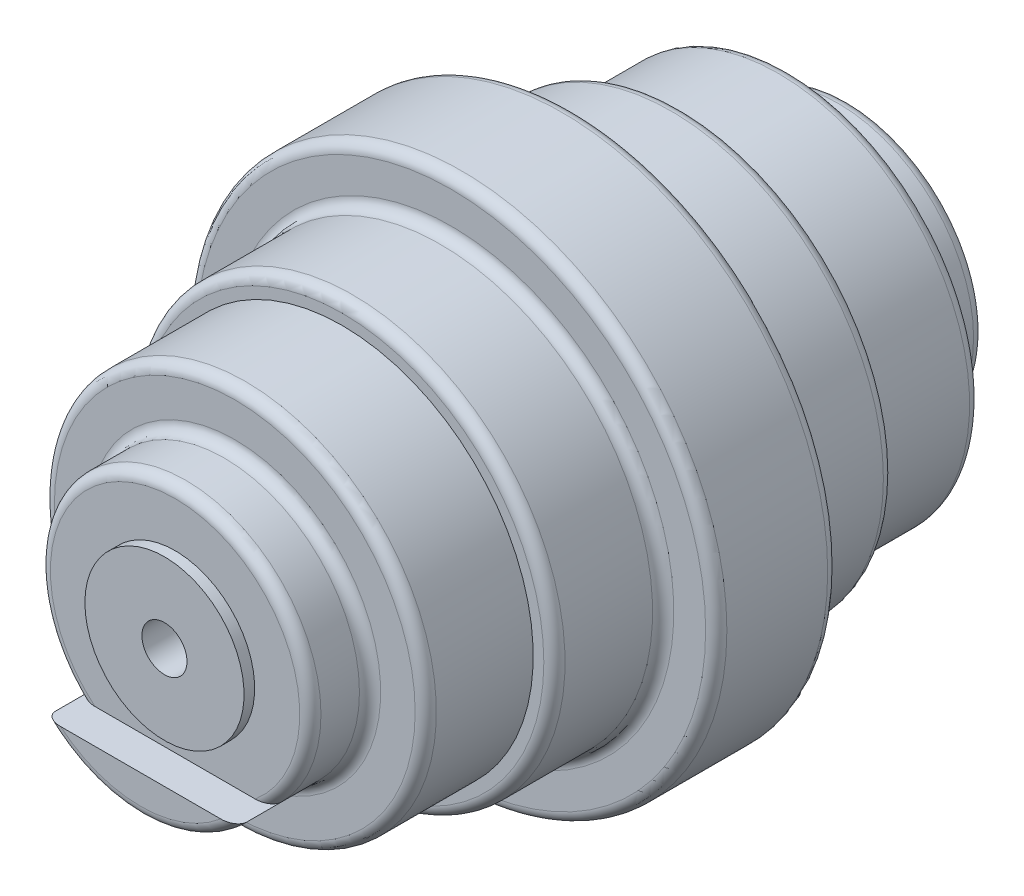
ISO-10303-21;
HEADER;
FILE_DESCRIPTION(('STEP AP214'),'2;1');
FILE_NAME('part.step','',(''),(''),'','','');
FILE_SCHEMA(('AUTOMOTIVE_DESIGN { 1 0 10303 214 1 1 1 1 }'));
ENDSEC;
DATA;
#1=APPLICATION_CONTEXT('core data for automotive mechanical design processes');
#2=APPLICATION_PROTOCOL_DEFINITION('international standard','automotive_design',2000,#1);
#3=PRODUCT_CONTEXT('',#1,'mechanical');
#4=PRODUCT('Part','Part','',(#3));
#5=PRODUCT_RELATED_PRODUCT_CATEGORY('part','',(#4));
#6=PRODUCT_DEFINITION_FORMATION('','',#4);
#7=PRODUCT_DEFINITION_CONTEXT('part definition',#1,'design');
#8=PRODUCT_DEFINITION('design','',#6,#7);
#9=PRODUCT_DEFINITION_SHAPE('','',#8);
#10=(LENGTH_UNIT() NAMED_UNIT(*) SI_UNIT(.MILLI.,.METRE.));
#11=(NAMED_UNIT(*) PLANE_ANGLE_UNIT() SI_UNIT($,.RADIAN.));
#12=(NAMED_UNIT(*) SI_UNIT($,.STERADIAN.) SOLID_ANGLE_UNIT());
#13=UNCERTAINTY_MEASURE_WITH_UNIT(LENGTH_MEASURE(1.E-05),#10,'distance_accuracy_value','');
#14=(GEOMETRIC_REPRESENTATION_CONTEXT(3) GLOBAL_UNCERTAINTY_ASSIGNED_CONTEXT((#13)) GLOBAL_UNIT_ASSIGNED_CONTEXT((#10,
#11,#12)) REPRESENTATION_CONTEXT('',''));
#15=CARTESIAN_POINT('',(0.,0.,0.));
#16=DIRECTION('',(0.,0.,1.));
#17=DIRECTION('',(1.,0.,0.));
#18=AXIS2_PLACEMENT_3D('',#15,#16,#17);
#19=CARTESIAN_POINT('',(0.,-36.,32.));
#20=DIRECTION('',(0.,0.,-1.));
#21=DIRECTION('',(0.,-1.,0.));
#22=AXIS2_PLACEMENT_3D('',#19,#20,#21);
#23=PLANE('',#22);
#24=CARTESIAN_POINT('',(0.,0.,32.));
#25=DIRECTION('',(0.,0.,1.));
#26=DIRECTION('',(0.,-1.,0.));
#27=AXIS2_PLACEMENT_3D('',#24,#25,#26);
#28=CIRCLE('',#27,36.);
#29=CARTESIAN_POINT('',(0.,-36.,32.));
#30=VERTEX_POINT('',#29);
#31=EDGE_CURVE('E118',#30,#30,#28,.T.);
#32=ORIENTED_EDGE('',*,*,#31,.F.);
#33=EDGE_LOOP('',(#32));
#34=FACE_BOUND('',#33,.T.);
#35=ADVANCED_FACE('F45',(#34),#23,.T.);
#36=CARTESIAN_POINT('',(0.,-25.5,70.));
#37=DIRECTION('',(0.,0.,1.));
#38=DIRECTION('',(0.,1.,0.));
#39=AXIS2_PLACEMENT_3D('',#36,#37,#38);
#40=PLANE('',#39);
#41=DIRECTION('',(-1.,0.,0.));
#42=VECTOR('',#41,1.);
#43=CARTESIAN_POINT('',(-50.,-18.,70.));
#44=LINE('',#43,#42);
#45=CARTESIAN_POINT('',(15.1079449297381,-18.,70.));
#46=VERTEX_POINT('',#45);
#47=CARTESIAN_POINT('',(-15.1079449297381,-18.,70.));
#48=VERTEX_POINT('',#47);
#49=EDGE_CURVE('E104',#46,#48,#44,.T.);
#50=ORIENTED_EDGE('',*,*,#49,.T.);
#51=CARTESIAN_POINT('',(0.,0.,70.));
#52=DIRECTION('',(0.,0.,-1.));
#53=DIRECTION('',(0.,1.,0.));
#54=AXIS2_PLACEMENT_3D('',#51,#52,#53);
#55=CIRCLE('',#54,23.5);
#56=EDGE_CURVE('E127',#46,#48,#55,.T.);
#57=ORIENTED_EDGE('',*,*,#56,.F.);
#58=EDGE_LOOP('',(#50,#57));
#59=FACE_BOUND('',#58,.T.);
#60=ADVANCED_FACE('F170',(#59),#40,.T.);
#61=CARTESIAN_POINT('',(0.,0.,0.));
#62=DIRECTION('',(0.,0.,-1.));
#63=DIRECTION('',(0.,-1.,0.));
#64=AXIS2_PLACEMENT_3D('',#61,#62,#63);
#65=CYLINDRICAL_SURFACE('',#64,25.5);
#66=DIRECTION('',(0.,0.,-1.));
#67=VECTOR('',#66,1.);
#68=CARTESIAN_POINT('',(18.0623918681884,-18.,0.));
#69=LINE('',#68,#67);
#70=CARTESIAN_POINT('',(18.0623918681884,-18.,61.5));
#71=VERTEX_POINT('',#70);
#72=CARTESIAN_POINT('',(18.0623918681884,-18.,68.));
#73=VERTEX_POINT('',#72);
#74=EDGE_CURVE('E112',#71,#73,#69,.F.);
#75=ORIENTED_EDGE('',*,*,#74,.T.);
#76=CARTESIAN_POINT('',(0.,0.,68.));
#77=DIRECTION('',(0.,0.,-1.));
#78=DIRECTION('',(0.,1.,0.));
#79=AXIS2_PLACEMENT_3D('',#76,#77,#78);
#80=CIRCLE('',#79,25.5);
#81=CARTESIAN_POINT('',(-18.0623918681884,-18.,68.));
#82=VERTEX_POINT('',#81);
#83=EDGE_CURVE('E124',#82,#73,#80,.F.);
#84=ORIENTED_EDGE('',*,*,#83,.F.);
#85=DIRECTION('',(0.,0.,-1.));
#86=VECTOR('',#85,1.);
#87=CARTESIAN_POINT('',(-18.0623918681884,-18.,0.));
#88=LINE('',#87,#86);
#89=CARTESIAN_POINT('',(-18.0623918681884,-18.,61.5));
#90=VERTEX_POINT('',#89);
#91=EDGE_CURVE('E115',#82,#90,#88,.T.);
#92=ORIENTED_EDGE('',*,*,#91,.T.);
#93=CARTESIAN_POINT('',(0.,0.,61.5));
#94=DIRECTION('',(0.,0.,-1.));
#95=DIRECTION('',(-1.,0.,0.));
#96=AXIS2_PLACEMENT_3D('',#93,#94,#95);
#97=CIRCLE('',#96,25.5);
#98=EDGE_CURVE('E184',#71,#90,#97,.F.);
#99=ORIENTED_EDGE('',*,*,#98,.F.);
#100=EDGE_LOOP('',(#75,#84,#92,#99));
#101=FACE_BOUND('',#100,.T.);
#102=CARTESIAN_POINT('',(0.,0.,54.25));
#103=DIRECTION('',(0.,0.,-1.));
#104=DIRECTION('',(0.,1.,0.));
#105=AXIS2_PLACEMENT_3D('',#102,#103,#104);
#106=CIRCLE('',#105,25.5);
#107=CARTESIAN_POINT('',(0.,25.5,54.25));
#108=VERTEX_POINT('',#107);
#109=EDGE_CURVE('E121',#108,#108,#106,.T.);
#110=ORIENTED_EDGE('',*,*,#109,.F.);
#111=EDGE_LOOP('',(#110));
#112=FACE_BOUND('',#111,.T.);
#113=ADVANCED_FACE('F167',(#101,#112),#65,.T.);
#114=CARTESIAN_POINT('',(0.,-36.,52.25));
#115=DIRECTION('',(0.,0.,1.));
#116=DIRECTION('',(0.,1.,0.));
#117=AXIS2_PLACEMENT_3D('',#114,#115,#116);
#118=PLANE('',#117);
#119=CARTESIAN_POINT('',(0.,0.,52.25));
#120=DIRECTION('',(0.,0.,-1.));
#121=DIRECTION('',(0.,1.,0.));
#122=AXIS2_PLACEMENT_3D('',#119,#120,#121);
#123=CIRCLE('',#122,27.5);
#124=CARTESIAN_POINT('',(0.,27.5,52.25));
#125=VERTEX_POINT('',#124);
#126=EDGE_CURVE('E133',#125,#125,#123,.F.);
#127=ORIENTED_EDGE('',*,*,#126,.F.);
#128=EDGE_LOOP('',(#127));
#129=FACE_BOUND('',#128,.T.);
#130=CARTESIAN_POINT('',(0.,0.,52.25));
#131=DIRECTION('',(0.,0.,-1.));
#132=DIRECTION('',(0.,1.,0.));
#133=AXIS2_PLACEMENT_3D('',#130,#131,#132);
#134=CIRCLE('',#133,34.);
#135=CARTESIAN_POINT('',(0.,34.,52.25));
#136=VERTEX_POINT('',#135);
#137=EDGE_CURVE('E130',#136,#136,#134,.T.);
#138=ORIENTED_EDGE('',*,*,#137,.F.);
#139=EDGE_LOOP('',(#138));
#140=FACE_BOUND('',#139,.T.);
#141=ADVANCED_FACE('F163',(#129,#140),#118,.T.);
#142=CARTESIAN_POINT('',(0.,0.,0.));
#143=DIRECTION('',(0.,0.,-1.));
#144=DIRECTION('',(0.,-1.,0.));
#145=AXIS2_PLACEMENT_3D('',#142,#143,#144);
#146=CYLINDRICAL_SURFACE('',#145,36.);
#147=CARTESIAN_POINT('',(0.,0.,50.25));
#148=DIRECTION('',(0.,0.,-1.));
#149=DIRECTION('',(0.,1.,0.));
#150=AXIS2_PLACEMENT_3D('',#147,#148,#149);
#151=CIRCLE('',#150,36.);
#152=CARTESIAN_POINT('',(0.,36.,50.25));
#153=VERTEX_POINT('',#152);
#154=EDGE_CURVE('E136',#153,#153,#151,.F.);
#155=ORIENTED_EDGE('',*,*,#154,.F.);
#156=EDGE_LOOP('',(#155));
#157=FACE_BOUND('',#156,.T.);
#158=ORIENTED_EDGE('',*,*,#31,.T.);
#159=EDGE_LOOP('',(#158));
#160=FACE_BOUND('',#159,.T.);
#161=ADVANCED_FACE('F158',(#157,#160),#146,.T.);
#162=CARTESIAN_POINT('',(0.,0.,68.));
#163=DIRECTION('',(0.,0.,1.));
#164=DIRECTION('',(0.,1.,0.));
#165=AXIS2_PLACEMENT_3D('',#162,#163,#164);
#166=TOROIDAL_SURFACE('',#165,23.5,2.);
#167=CARTESIAN_POINT('',(-17.731381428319,-18.,68.937586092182));
#168=CARTESIAN_POINT('',(-17.7841665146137,-18.,68.8677870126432));
#169=CARTESIAN_POINT('',(-17.8320811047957,-18.,68.7942687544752));
#170=CARTESIAN_POINT('',(-17.9158778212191,-18.,68.6406099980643));
#171=CARTESIAN_POINT('',(-17.9517634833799,-18.,68.5604714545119));
#172=CARTESIAN_POINT('',(-18.0094884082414,-18.,68.3946412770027));
#173=CARTESIAN_POINT('',(-18.0312368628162,-18.,68.3089175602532));
#174=CARTESIAN_POINT('',(-18.0586650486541,-18.,68.1349346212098));
#175=CARTESIAN_POINT('',(-18.0643530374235,-18.,68.0466767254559));
#176=CARTESIAN_POINT('',(-18.0594118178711,-18.,67.8770825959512));
#177=CARTESIAN_POINT('',(-18.0499397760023,-18.,67.7957099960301));
#178=CARTESIAN_POINT('',(-18.0174832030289,-18.,67.6357267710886));
#179=CARTESIAN_POINT('',(-17.9944968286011,-18.,67.5571165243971));
#180=CARTESIAN_POINT('',(-17.9363306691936,-18.,67.4042397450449));
#181=CARTESIAN_POINT('',(-17.9011023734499,-18.,67.3299918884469));
#182=CARTESIAN_POINT('',(-17.8203155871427,-18.,67.1873907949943));
#183=CARTESIAN_POINT('',(-17.7747523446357,-18.,67.1190402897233));
#184=CARTESIAN_POINT('',(-17.6518652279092,-18.,66.9584535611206));
#185=CARTESIAN_POINT('',(-17.5696428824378,-18.,66.8699577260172));
#186=CARTESIAN_POINT('',(-17.3920278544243,-18.,66.7073440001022));
#187=CARTESIAN_POINT('',(-17.296606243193,-18.,66.6332585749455));
#188=CARTESIAN_POINT('',(-17.0555504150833,-18.,66.4713512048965));
#189=CARTESIAN_POINT('',(-16.9053616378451,-18.,66.3903380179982));
#190=CARTESIAN_POINT('',(-16.5941877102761,-18.,66.2529311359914));
#191=CARTESIAN_POINT('',(-16.433185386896,-18.,66.1965777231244));
#192=CARTESIAN_POINT('',(-16.1526817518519,-18.,66.1189722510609));
#193=CARTESIAN_POINT('',(-16.0346280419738,-18.,66.0922828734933));
#194=CARTESIAN_POINT('',(-15.7966123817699,-18.,66.0491959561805));
#195=CARTESIAN_POINT('',(-15.6766496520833,-18.,66.0328027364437));
#196=CARTESIAN_POINT('',(-15.4356699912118,-18.,66.0096556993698));
#197=CARTESIAN_POINT('',(-15.3146519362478,-18.,66.0029138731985));
#198=CARTESIAN_POINT('',(-15.0724796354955,-18.,65.9986064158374));
#199=CARTESIAN_POINT('',(-14.951325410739,-18.,66.0010395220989));
#200=CARTESIAN_POINT('',(-14.7061329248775,-18.,66.0149273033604));
#201=CARTESIAN_POINT('',(-14.5821089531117,-18.,66.0266328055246));
#202=CARTESIAN_POINT('',(-14.3352653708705,-18.,66.0591784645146));
#203=CARTESIAN_POINT('',(-14.2124457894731,-18.,66.0800188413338));
#204=CARTESIAN_POINT('',(-13.9688242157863,-18.,66.1308078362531));
#205=CARTESIAN_POINT('',(-13.8480202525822,-18.,66.1607469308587));
#206=CARTESIAN_POINT('',(-13.6091746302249,-18.,66.2299436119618));
#207=CARTESIAN_POINT('',(-13.4911319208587,-18.,66.2691975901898));
#208=CARTESIAN_POINT('',(-13.2235961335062,-18.,66.370867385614));
#209=CARTESIAN_POINT('',(-13.0753533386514,-18.,66.4366981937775));
#210=CARTESIAN_POINT('',(-12.860373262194,-18.,66.5493314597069));
#211=CARTESIAN_POINT('',(-12.7899546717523,-18.,66.5891828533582));
#212=CARTESIAN_POINT('',(-12.6522179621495,-18.,66.673909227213));
#213=CARTESIAN_POINT('',(-12.584898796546,-18.,66.7187824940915));
#214=CARTESIAN_POINT('',(-12.4303670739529,-18.,66.8313727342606));
#215=CARTESIAN_POINT('',(-12.3448457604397,-18.,66.9014549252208));
#216=CARTESIAN_POINT('',(-12.1846059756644,-18.,67.0531114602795));
#217=CARTESIAN_POINT('',(-12.1098688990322,-18.,67.1346655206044));
#218=CARTESIAN_POINT('',(-11.9970694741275,-18.,67.2833275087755));
#219=CARTESIAN_POINT('',(-11.954786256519,-18.,67.3472058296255));
#220=CARTESIAN_POINT('',(-11.8806585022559,-18.,67.4807832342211));
#221=CARTESIAN_POINT('',(-11.8487976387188,-18.,67.5504729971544));
#222=CARTESIAN_POINT('',(-11.8024897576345,-18.,67.6827568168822));
#223=CARTESIAN_POINT('',(-11.7860456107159,-18.,67.7446442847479));
#224=CARTESIAN_POINT('',(-11.76385563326,-18.,67.870310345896));
#225=CARTESIAN_POINT('',(-11.7581017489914,-18.,67.9340874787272));
#226=CARTESIAN_POINT('',(-11.757854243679,-18.,68.0617494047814));
#227=CARTESIAN_POINT('',(-11.7633755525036,-18.,68.1256342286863));
#228=CARTESIAN_POINT('',(-11.7851503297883,-18.,68.2515448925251));
#229=CARTESIAN_POINT('',(-11.8014119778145,-18.,68.3135692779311));
#230=CARTESIAN_POINT('',(-11.8485040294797,-18.,68.4493937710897));
#231=CARTESIAN_POINT('',(-11.881954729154,-18.,68.5222777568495));
#232=CARTESIAN_POINT('',(-11.9601594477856,-18.,68.661682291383));
#233=CARTESIAN_POINT('',(-12.004935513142,-18.,68.7281900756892));
#234=CARTESIAN_POINT('',(-12.1283580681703,-18.,68.8875910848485));
#235=CARTESIAN_POINT('',(-12.2125011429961,-18.,68.97619213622));
#236=CARTESIAN_POINT('',(-12.3931031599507,-18.,69.1397163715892));
#237=CARTESIAN_POINT('',(-12.4895913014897,-18.,69.2146060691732));
#238=CARTESIAN_POINT('',(-12.6747677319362,-18.,69.3414303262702));
#239=CARTESIAN_POINT('',(-12.7622735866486,-18.,69.3951220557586));
#240=CARTESIAN_POINT('',(-12.9415922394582,-18.,69.4948377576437));
#241=CARTESIAN_POINT('',(-13.0334077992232,-18.,69.5408567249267));
#242=CARTESIAN_POINT('',(-13.2203858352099,-18.,69.6258782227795));
#243=CARTESIAN_POINT('',(-13.3155534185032,-18.,69.6648694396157));
#244=CARTESIAN_POINT('',(-13.5083623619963,-18.,69.7361842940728));
#245=CARTESIAN_POINT('',(-13.6060043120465,-18.,69.7685063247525));
#246=CARTESIAN_POINT('',(-13.8383255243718,-18.,69.8371402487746));
#247=CARTESIAN_POINT('',(-13.9738029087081,-18.,69.8707689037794));
#248=CARTESIAN_POINT('',(-14.2471268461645,-18.,69.9265879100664));
#249=CARTESIAN_POINT('',(-14.3849743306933,-18.,69.9487736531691));
#250=CARTESIAN_POINT('',(-14.6619890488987,-18.,69.9816472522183));
#251=CARTESIAN_POINT('',(-14.80115572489,-18.,69.9923397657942));
#252=CARTESIAN_POINT('',(-15.0798285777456,-18.,70.0018991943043));
#253=CARTESIAN_POINT('',(-15.2193346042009,-18.,70.0007706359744));
#254=CARTESIAN_POINT('',(-15.5716014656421,-18.,69.9822140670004));
#255=CARTESIAN_POINT('',(-15.7839999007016,-18.,69.9564643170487));
#256=CARTESIAN_POINT('',(-16.2022348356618,-18.,69.8724792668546));
#257=CARTESIAN_POINT('',(-16.4080831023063,-18.,69.8143061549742));
#258=CARTESIAN_POINT('',(-16.7393543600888,-18.,69.6862444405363));
#259=CARTESIAN_POINT('',(-16.8687659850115,-18.,69.626678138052));
#260=CARTESIAN_POINT('',(-17.1174503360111,-18.,69.4892295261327));
#261=CARTESIAN_POINT('',(-17.2367434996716,-18.,69.4113853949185));
#262=CARTESIAN_POINT('',(-17.4197733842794,-18.,69.2675250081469));
#263=CARTESIAN_POINT('',(-17.4880757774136,-18.,69.207301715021));
#264=CARTESIAN_POINT('',(-17.6164626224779,-18.,69.0785835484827));
#265=CARTESIAN_POINT('',(-17.6765497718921,-18.,69.0100914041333));
#266=CARTESIAN_POINT('',(-17.731381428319,-18.,68.937586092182));
#267=B_SPLINE_CURVE_WITH_KNOTS('',3,(#167,#168,#169,#170,#171,#172,#173,#174,#175,#176,#177,
#178,#179,#180,#181,#182,#183,#184,#185,#186,#187,#188,#189,#190,#191,#192,#193,#194,#195,#196,
#197,#198,#199,#200,#201,#202,#203,#204,#205,#206,#207,#208,#209,#210,#211,#212,#213,#214,#215,
#216,#217,#218,#219,#220,#221,#222,#223,#224,#225,#226,#227,#228,#229,#230,#231,#232,#233,#234,
#235,#236,#237,#238,#239,#240,#241,#242,#243,#244,#245,#246,#247,#248,#249,#250,#251,#252,#253,
#254,#255,#256,#257,#258,#259,#260,#261,#262,#263,#264,#265,#266),.UNSPECIFIED.,.T.,.F.,(4,2,2,
2,2,2,2,2,2,2,2,2,2,2,2,2,2,2,2,2,2,2,2,2,2,2,2,2,2,2,2,2,2,2,2,2,2,2,2,2,2,2,2,2,2,2,2,2,2,4),
(0.,0.262308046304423,0.524538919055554,0.788437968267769,1.05220130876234,1.29677255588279,
1.5413771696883,1.78696233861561,2.03266065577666,2.39302948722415,2.75420103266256,
3.26335277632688,3.77333315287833,4.1359854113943,4.49878972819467,4.86204441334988,
5.225249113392,5.5986288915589,5.97201766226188,6.34501695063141,6.71787198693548,
7.20316366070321,7.44573136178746,7.68821655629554,8.01907383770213,8.34935330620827,
8.57843952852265,8.80716514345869,8.9984391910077,9.18956907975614,9.38095221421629,
9.57248126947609,9.81172813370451,10.0514443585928,10.4159747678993,10.7813839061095,
11.0889605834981,11.3967371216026,11.7050047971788,12.013346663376,12.4315759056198,
12.8499734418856,13.2682013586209,13.6862691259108,14.3259139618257,14.9643361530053,
15.390539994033,15.8158613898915,16.0884292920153,16.3609074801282),.UNSPECIFIED.);
#268=EDGE_CURVE('E144',#48,#82,#267,.T.);
#269=ORIENTED_EDGE('',*,*,#268,.T.);
#270=ORIENTED_EDGE('',*,*,#83,.T.);
#271=CARTESIAN_POINT('',(11.7588246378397,-18.,68.0430838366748));
#272=CARTESIAN_POINT('',(11.7562971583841,-18.,67.9787135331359));
#273=CARTESIAN_POINT('',(11.75948631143,-18.,67.9140596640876));
#274=CARTESIAN_POINT('',(11.7770155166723,-18.,67.7862608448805));
#275=CARTESIAN_POINT('',(11.7913701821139,-18.,67.7231179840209));
#276=CARTESIAN_POINT('',(11.8297805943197,-18.,67.6003826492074));
#277=CARTESIAN_POINT('',(11.8537700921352,-18.,67.5407690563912));
#278=CARTESIAN_POINT('',(11.9097479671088,-18.,67.4254830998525));
#279=CARTESIAN_POINT('',(11.9417390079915,-18.,67.3698120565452));
#280=CARTESIAN_POINT('',(12.0364214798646,-18.,67.2256268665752));
#281=CARTESIAN_POINT('',(12.1050464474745,-18.,67.1410173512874));
#282=CARTESIAN_POINT('',(12.2544623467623,-18.,66.983252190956));
#283=CARTESIAN_POINT('',(12.3352930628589,-18.,66.9101356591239));
#284=CARTESIAN_POINT('',(12.4910449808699,-18.,66.7855550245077));
#285=CARTESIAN_POINT('',(12.5647245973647,-18.,66.7325108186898));
#286=CARTESIAN_POINT('',(12.7163936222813,-18.,66.6329274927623));
#287=CARTESIAN_POINT('',(12.7943858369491,-18.,66.5863926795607));
#288=CARTESIAN_POINT('',(12.953708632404,-18.,66.4992569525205));
#289=CARTESIAN_POINT('',(13.0350428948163,-18.,66.4586628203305));
#290=CARTESIAN_POINT('',(13.2002656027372,-18.,66.3830354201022));
#291=CARTESIAN_POINT('',(13.2841547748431,-18.,66.3480037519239));
#292=CARTESIAN_POINT('',(13.4956865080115,-18.,66.2672556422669));
#293=CARTESIAN_POINT('',(13.6245634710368,-18.,66.2247534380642));
#294=CARTESIAN_POINT('',(13.8854743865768,-18.,66.1507931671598));
#295=CARTESIAN_POINT('',(14.0175097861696,-18.,66.1193402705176));
#296=CARTESIAN_POINT('',(14.2839302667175,-18.,66.067205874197));
#297=CARTESIAN_POINT('',(14.418319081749,-18.,66.0465434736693));
#298=CARTESIAN_POINT('',(14.688299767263,-18.,66.0161362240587));
#299=CARTESIAN_POINT('',(14.8238913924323,-18.,66.0063891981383));
#300=CARTESIAN_POINT('',(15.0973327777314,-18.,65.9980732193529));
#301=CARTESIAN_POINT('',(15.2351875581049,-18.,65.9996628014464));
#302=CARTESIAN_POINT('',(15.510289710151,-18.,66.0150021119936));
#303=CARTESIAN_POINT('',(15.6475368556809,-18.,66.0287560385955));
#304=CARTESIAN_POINT('',(15.9196372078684,-18.,66.0692258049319));
#305=CARTESIAN_POINT('',(16.0544972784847,-18.,66.0958945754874));
#306=CARTESIAN_POINT('',(16.3205791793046,-18.,66.1632665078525));
#307=CARTESIAN_POINT('',(16.451804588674,-18.,66.2039552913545));
#308=CARTESIAN_POINT('',(16.7124928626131,-18.,66.3022299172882));
#309=CARTESIAN_POINT('',(16.8417773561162,-18.,66.360297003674));
#310=CARTESIAN_POINT('',(17.0906836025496,-18.,66.4944593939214));
#311=CARTESIAN_POINT('',(17.2103165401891,-18.,66.5705334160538));
#312=CARTESIAN_POINT('',(17.4118309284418,-18.,66.7245928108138));
#313=CARTESIAN_POINT('',(17.4964281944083,-18.,66.7990020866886));
#314=CARTESIAN_POINT('',(17.6526521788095,-18.,66.960442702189));
#315=CARTESIAN_POINT('',(17.7242965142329,-18.,67.0474566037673));
#316=CARTESIAN_POINT('',(17.8371346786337,-18.,67.2140717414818));
#317=CARTESIAN_POINT('',(17.881562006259,-18.,67.2914740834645));
#318=CARTESIAN_POINT('',(17.9570656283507,-18.,67.4525772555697));
#319=CARTESIAN_POINT('',(17.988150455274,-18.,67.5362740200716));
#320=CARTESIAN_POINT('',(18.0349862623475,-18.,67.7084674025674));
#321=CARTESIAN_POINT('',(18.0506421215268,-18.,67.7969902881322));
#322=CARTESIAN_POINT('',(18.0649914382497,-18.,67.9754016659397));
#323=CARTESIAN_POINT('',(18.0636909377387,-18.,68.0652896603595));
#324=CARTESIAN_POINT('',(18.0452393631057,-18.,68.2343349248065));
#325=CARTESIAN_POINT('',(18.0296738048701,-18.,68.3136719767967));
#326=CARTESIAN_POINT('',(17.9859377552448,-18.,68.4687609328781));
#327=CARTESIAN_POINT('',(17.9577659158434,-18.,68.544512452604));
#328=CARTESIAN_POINT('',(17.889047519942,-18.,68.693839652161));
#329=CARTESIAN_POINT('',(17.8480487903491,-18.,68.7672052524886));
#330=CARTESIAN_POINT('',(17.7561490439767,-18.,68.9074018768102));
#331=CARTESIAN_POINT('',(17.7052427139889,-18.,68.9742293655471));
#332=CARTESIAN_POINT('',(17.5667410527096,-18.,69.1340165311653));
#333=CARTESIAN_POINT('',(17.4738641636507,-18.,69.2224105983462));
#334=CARTESIAN_POINT('',(17.2751489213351,-18.,69.3832023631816));
#335=CARTESIAN_POINT('',(17.1692799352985,-18.,69.4555610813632));
#336=CARTESIAN_POINT('',(16.9020854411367,-18.,69.6126443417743));
#337=CARTESIAN_POINT('',(16.7362430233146,-18.,69.6896551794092));
#338=CARTESIAN_POINT('',(16.3946309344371,-18.,69.8166829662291));
#339=CARTESIAN_POINT('',(16.2188472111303,-18.,69.8666605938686));
#340=CARTESIAN_POINT('',(15.9159734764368,-18.,69.9312055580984));
#341=CARTESIAN_POINT('',(15.7901280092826,-18.,69.9519010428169));
#342=CARTESIAN_POINT('',(15.5370752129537,-18.,69.982390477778));
#343=CARTESIAN_POINT('',(15.4098673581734,-18.,69.9921800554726));
#344=CARTESIAN_POINT('',(15.1548573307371,-18.,70.0014857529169));
#345=CARTESIAN_POINT('',(15.0270544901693,-18.,70.0009825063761));
#346=CARTESIAN_POINT('',(14.7718971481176,-18.,69.9900994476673));
#347=CARTESIAN_POINT('',(14.6445425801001,-18.,69.9797211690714));
#348=CARTESIAN_POINT('',(14.388115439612,-18.,69.9489920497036));
#349=CARTESIAN_POINT('',(14.2590692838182,-18.,69.9284206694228));
#350=CARTESIAN_POINT('',(14.0029389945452,-18.,69.8772353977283));
#351=CARTESIAN_POINT('',(13.8758554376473,-18.,69.8466186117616));
#352=CARTESIAN_POINT('',(13.6249458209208,-18.,69.7752114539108));
#353=CARTESIAN_POINT('',(13.5011116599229,-18.,69.7344497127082));
#354=CARTESIAN_POINT('',(13.2575763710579,-18.,69.6421861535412));
#355=CARTESIAN_POINT('',(13.1378722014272,-18.,69.5906924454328));
#356=CARTESIAN_POINT('',(12.9055942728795,-18.,69.4766869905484));
#357=CARTESIAN_POINT('',(12.7929510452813,-18.,69.4143181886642));
#358=CARTESIAN_POINT('',(12.5756818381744,-18.,69.2766829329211));
#359=CARTESIAN_POINT('',(12.4710537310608,-18.,69.2014199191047));
#360=CARTESIAN_POINT('',(12.2924498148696,-18.,69.0514994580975));
#361=CARTESIAN_POINT('',(12.2163956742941,-18.,68.979344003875));
#362=CARTESIAN_POINT('',(12.0762545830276,-18.,68.8241154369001));
#363=CARTESIAN_POINT('',(12.0121435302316,-18.,68.7410649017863));
#364=CARTESIAN_POINT('',(11.9196146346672,-18.,68.5927099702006));
#365=CARTESIAN_POINT('',(11.8863716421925,-18.,68.5304308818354));
#366=CARTESIAN_POINT('',(11.8302267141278,-18.,68.4014197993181));
#367=CARTESIAN_POINT('',(11.8072973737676,-18.,68.334700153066));
#368=CARTESIAN_POINT('',(11.7815761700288,-18.,68.2299141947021));
#369=CARTESIAN_POINT('',(11.7743764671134,-18.,68.1928981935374));
#370=CARTESIAN_POINT('',(11.763739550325,-18.,68.1183152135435));
#371=CARTESIAN_POINT('',(11.7603035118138,-18.,68.0807480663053));
#372=CARTESIAN_POINT('',(11.7588246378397,-18.,68.0430838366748));
#373=B_SPLINE_CURVE_WITH_KNOTS('',3,(#271,#272,#273,#274,#275,#276,#277,#278,#279,#280,#281,
#282,#283,#284,#285,#286,#287,#288,#289,#290,#291,#292,#293,#294,#295,#296,#297,#298,#299,#300,
#301,#302,#303,#304,#305,#306,#307,#308,#309,#310,#311,#312,#313,#314,#315,#316,#317,#318,#319,
#320,#321,#322,#323,#324,#325,#326,#327,#328,#329,#330,#331,#332,#333,#334,#335,#336,#337,#338,
#339,#340,#341,#342,#343,#344,#345,#346,#347,#348,#349,#350,#351,#352,#353,#354,#355,#356,#357,
#358,#359,#360,#361,#362,#363,#364,#365,#366,#367,#368,#369,#370,#371,#372),.UNSPECIFIED.,.T.,
.F.,(4,2,2,2,2,2,2,2,2,2,2,2,2,2,2,2,2,2,2,2,2,2,2,2,2,2,2,2,2,2,2,2,2,2,2,2,2,2,2,2,2,2,2,2,2,
2,2,2,2,2,4),(0.,0.193111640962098,0.386476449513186,0.578533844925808,0.770655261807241,
1.09560813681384,1.4216440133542,1.69363288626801,1.96580087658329,2.2382771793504,
2.510831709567,2.91738263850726,3.32412354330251,3.73158195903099,4.13895910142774,
4.55204420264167,4.96527192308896,5.37700480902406,5.78831669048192,6.21228021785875,
6.63574515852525,6.97256292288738,7.30891908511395,7.57559244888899,7.84209502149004,
8.1102305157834,8.37827046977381,8.61971518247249,8.86118571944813,9.11236901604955,
9.36368738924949,9.74617777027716,10.1295879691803,10.6751600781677,11.2215236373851,
11.6036695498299,11.9859686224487,12.3689870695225,12.7519460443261,13.1435784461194,
13.5353237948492,13.9259758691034,14.3163338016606,14.7019020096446,15.0873675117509,
15.400984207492,15.7139609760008,15.925042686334,16.1355601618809,16.2485180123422,
16.3615111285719),.UNSPECIFIED.);
#374=EDGE_CURVE('E139',#73,#46,#373,.T.);
#375=ORIENTED_EDGE('',*,*,#374,.T.);
#376=ORIENTED_EDGE('',*,*,#56,.T.);
#377=EDGE_LOOP('',(#269,#270,#375,#376));
#378=FACE_BOUND('',#377,.T.);
#379=ADVANCED_FACE('F152',(#378),#166,.T.);
#380=CARTESIAN_POINT('',(0.,0.,54.25));
#381=DIRECTION('',(0.,0.,1.));
#382=DIRECTION('',(0.,1.,0.));
#383=AXIS2_PLACEMENT_3D('',#380,#381,#382);
#384=TOROIDAL_SURFACE('',#383,27.5,2.);
#385=ORIENTED_EDGE('',*,*,#109,.T.);
#386=EDGE_LOOP('',(#385));
#387=FACE_BOUND('',#386,.T.);
#388=ORIENTED_EDGE('',*,*,#126,.T.);
#389=EDGE_LOOP('',(#388));
#390=FACE_BOUND('',#389,.T.);
#391=ADVANCED_FACE('F157',(#387,#390),#384,.F.);
#392=CARTESIAN_POINT('',(0.,0.,50.25));
#393=DIRECTION('',(0.,0.,1.));
#394=DIRECTION('',(0.,1.,0.));
#395=AXIS2_PLACEMENT_3D('',#392,#393,#394);
#396=TOROIDAL_SURFACE('',#395,34.,2.);
#397=ORIENTED_EDGE('',*,*,#137,.T.);
#398=EDGE_LOOP('',(#397));
#399=FACE_BOUND('',#398,.T.);
#400=ORIENTED_EDGE('',*,*,#154,.T.);
#401=EDGE_LOOP('',(#400));
#402=FACE_BOUND('',#401,.T.);
#403=ADVANCED_FACE('F256',(#399,#402),#396,.T.);
#404=CARTESIAN_POINT('',(-50.,-18.,65.5));
#405=DIRECTION('',(0.,-1.,0.));
#406=DIRECTION('',(1.,0.,0.));
#407=AXIS2_PLACEMENT_3D('',#404,#405,#406);
#408=PLANE('',#407);
#409=ORIENTED_EDGE('',*,*,#91,.F.);
#410=ORIENTED_EDGE('',*,*,#268,.F.);
#411=ORIENTED_EDGE('',*,*,#49,.F.);
#412=ORIENTED_EDGE('',*,*,#374,.F.);
#413=ORIENTED_EDGE('',*,*,#74,.F.);
#414=CARTESIAN_POINT('',(15.1079449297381,-18.,63.5));
#415=CARTESIAN_POINT('',(15.2318048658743,-18.,63.4999685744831));
#416=CARTESIAN_POINT('',(15.3557219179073,-18.,63.4952409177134));
#417=CARTESIAN_POINT('',(15.6031157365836,-18.,63.4757282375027));
#418=CARTESIAN_POINT('',(15.726590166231,-18.,63.4609139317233));
#419=CARTESIAN_POINT('',(15.9733669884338,-18.,63.4202996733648));
#420=CARTESIAN_POINT('',(16.0966473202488,-18.,63.3943627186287));
#421=CARTESIAN_POINT('',(16.3399594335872,-18.,63.330629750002));
#422=CARTESIAN_POINT('',(16.4599953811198,-18.,63.292849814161));
#423=CARTESIAN_POINT('',(16.7110070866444,-18.,63.1984492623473));
#424=CARTESIAN_POINT('',(16.8413045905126,-18.,63.1399869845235));
#425=CARTESIAN_POINT('',(17.0917570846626,-18.,63.0049328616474));
#426=CARTESIAN_POINT('',(17.2119484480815,-18.,62.9284101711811));
#427=CARTESIAN_POINT('',(17.4136083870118,-18.,62.7738941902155));
#428=CARTESIAN_POINT('',(17.4978997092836,-18.,62.6996088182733));
#429=CARTESIAN_POINT('',(17.6536048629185,-18.,62.5384396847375));
#430=CARTESIAN_POINT('',(17.7250292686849,-18.,62.4515663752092));
#431=CARTESIAN_POINT('',(17.8376711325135,-18.,62.2850518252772));
#432=CARTESIAN_POINT('',(17.8820792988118,-18.,62.207575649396));
#433=CARTESIAN_POINT('',(17.9574675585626,-18.,62.0464103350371));
#434=CARTESIAN_POINT('',(17.9884756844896,-18.,61.9627345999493));
#435=CARTESIAN_POINT('',(18.0283727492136,-18.,61.8156995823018));
#436=CARTESIAN_POINT('',(18.0410480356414,-18.,61.7533529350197));
#437=CARTESIAN_POINT('',(18.058094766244,-18.,61.6273602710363));
#438=CARTESIAN_POINT('',(18.0624425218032,-18.,61.5637110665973));
#439=CARTESIAN_POINT('',(18.0623918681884,-18.,61.5));
#440=B_SPLINE_CURVE_WITH_KNOTS('',3,(#414,#415,#416,#417,#418,#419,#420,#421,#422,#423,#424,
#425,#426,#427,#428,#429,#430,#431,#432,#433,#434,#435,#436,#437,#438,#439),.UNSPECIFIED.,.F.,
.F.,(4,2,2,2,2,2,2,2,2,2,2,2,4),(0.,0.371576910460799,0.744237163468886,1.12162577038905,
1.49850423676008,1.92568541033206,2.35125668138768,2.68714901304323,3.02276402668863,
3.28961595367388,3.55590689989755,3.74624405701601,3.9371218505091),.UNSPECIFIED.);
#441=CARTESIAN_POINT('',(15.1079449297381,-18.,63.5));
#442=VERTEX_POINT('',#441);
#443=EDGE_CURVE('E57',#442,#71,#440,.T.);
#444=ORIENTED_EDGE('',*,*,#443,.F.);
#445=DIRECTION('',(-1.,0.,0.));
#446=VECTOR('',#445,1.);
#447=CARTESIAN_POINT('',(18.0623918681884,-18.,63.5));
#448=LINE('',#447,#446);
#449=CARTESIAN_POINT('',(-15.1079449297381,-18.,63.5));
#450=VERTEX_POINT('',#449);
#451=EDGE_CURVE('E101',#442,#450,#448,.T.);
#452=ORIENTED_EDGE('',*,*,#451,.T.);
#453=CARTESIAN_POINT('',(-18.0623918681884,-18.,61.5));
#454=CARTESIAN_POINT('',(-18.0624065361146,-18.,61.5445867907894));
#455=CARTESIAN_POINT('',(-18.0602874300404,-18.,61.5891657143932));
#456=CARTESIAN_POINT('',(-18.0518944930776,-18.,61.6778998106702));
#457=CARTESIAN_POINT('',(-18.0456236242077,-18.,61.7220552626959));
#458=CARTESIAN_POINT('',(-18.0291060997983,-18.,61.8092484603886));
#459=CARTESIAN_POINT('',(-18.0188916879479,-18.,61.852292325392));
#460=CARTESIAN_POINT('',(-17.9946916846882,-18.,61.9372980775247));
#461=CARTESIAN_POINT('',(-17.9807056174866,-18.,61.9792598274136));
#462=CARTESIAN_POINT('',(-17.9335245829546,-18.,62.1028715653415));
#463=CARTESIAN_POINT('',(-17.8950457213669,-18.,62.1825576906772));
#464=CARTESIAN_POINT('',(-17.80625054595,-18.,62.3350868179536));
#465=CARTESIAN_POINT('',(-17.7559092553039,-18.,62.4079149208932));
#466=CARTESIAN_POINT('',(-17.6243188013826,-18.,62.572721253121));
#467=CARTESIAN_POINT('',(-17.5386535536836,-18.,62.6611769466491));
#468=CARTESIAN_POINT('',(-17.3542900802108,-18.,62.8231377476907));
#469=CARTESIAN_POINT('',(-17.255571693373,-18.,62.8966192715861));
#470=CARTESIAN_POINT('',(-17.0062412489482,-18.,63.0569435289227));
#471=CARTESIAN_POINT('',(-16.851086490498,-18.,63.1366894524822));
#472=CARTESIAN_POINT('',(-16.5299440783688,-18.,63.2709603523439));
#473=CARTESIAN_POINT('',(-16.3639210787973,-18.,63.3253978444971));
#474=CARTESIAN_POINT('',(-16.1060256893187,-18.,63.3912370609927));
#475=CARTESIAN_POINT('',(-16.016131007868,-18.,63.410824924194));
#476=CARTESIAN_POINT('',(-15.8352142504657,-18.,63.444031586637));
#477=CARTESIAN_POINT('',(-15.7441919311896,-18.,63.4576490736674));
#478=CARTESIAN_POINT('',(-15.562413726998,-18.,63.4790995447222));
#479=CARTESIAN_POINT('',(-15.4716644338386,-18.,63.4869895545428));
#480=CARTESIAN_POINT('',(-15.2899207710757,-18.,63.497433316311));
#481=CARTESIAN_POINT('',(-15.1989266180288,-18.,63.4999908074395));
#482=CARTESIAN_POINT('',(-15.1079449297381,-18.,63.5));
#483=B_SPLINE_CURVE_WITH_KNOTS('',3,(#453,#454,#455,#456,#457,#458,#459,#460,#461,#462,#463,
#464,#465,#466,#467,#468,#469,#470,#471,#472,#473,#474,#475,#476,#477,#478,#479,#480,#481,#482),
.UNSPECIFIED.,.F.,.F.,(4,2,2,2,2,2,2,2,2,2,2,2,2,2,4),(0.,0.133697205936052,0.267299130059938,
0.39983105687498,0.532379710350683,0.796542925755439,1.06126739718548,1.42862663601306,
1.7965600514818,2.31708038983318,2.8393868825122,3.11523096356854,3.3911356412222,
3.66425411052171,3.93718100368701),.UNSPECIFIED.);
#484=EDGE_CURVE('E12',#90,#450,#483,.T.);
#485=ORIENTED_EDGE('',*,*,#484,.F.);
#486=EDGE_LOOP('',(#409,#410,#411,#412,#413,#444,#452,#485));
#487=FACE_BOUND('',#486,.T.);
#488=ADVANCED_FACE('F148',(#487),#408,.F.);
#489=CARTESIAN_POINT('',(0.,0.,63.5));
#490=DIRECTION('',(0.,0.,1.));
#491=DIRECTION('',(-1.,0.,0.));
#492=AXIS2_PLACEMENT_3D('',#489,#490,#491);
#493=PLANE('',#492);
#494=CARTESIAN_POINT('',(0.,0.,63.5));
#495=DIRECTION('',(0.,0.,-1.));
#496=DIRECTION('',(-1.,0.,0.));
#497=AXIS2_PLACEMENT_3D('',#494,#495,#496);
#498=CIRCLE('',#497,15.);
#499=CARTESIAN_POINT('',(-15.,0.,63.5));
#500=VERTEX_POINT('',#499);
#501=EDGE_CURVE('E106',#500,#500,#498,.T.);
#502=ORIENTED_EDGE('',*,*,#501,.T.);
#503=EDGE_LOOP('',(#502));
#504=FACE_BOUND('',#503,.T.);
#505=ORIENTED_EDGE('',*,*,#451,.F.);
#506=CARTESIAN_POINT('',(0.,0.,63.5));
#507=DIRECTION('',(0.,0.,-1.));
#508=DIRECTION('',(-1.,0.,0.));
#509=AXIS2_PLACEMENT_3D('',#506,#507,#508);
#510=CIRCLE('',#509,23.5);
#511=EDGE_CURVE('E182',#450,#442,#510,.T.);
#512=ORIENTED_EDGE('',*,*,#511,.F.);
#513=EDGE_LOOP('',(#505,#512));
#514=FACE_BOUND('',#513,.T.);
#515=ADVANCED_FACE('F198',(#504,#514),#493,.T.);
#516=CARTESIAN_POINT('',(0.,0.,63.5));
#517=DIRECTION('',(0.,0.,1.));
#518=DIRECTION('',(-1.,0.,0.));
#519=AXIS2_PLACEMENT_3D('',#516,#517,#518);
#520=CYLINDRICAL_SURFACE('',#519,15.);
#521=ORIENTED_EDGE('',*,*,#501,.F.);
#522=EDGE_LOOP('',(#521));
#523=FACE_BOUND('',#522,.T.);
#524=CARTESIAN_POINT('',(0.,0.,65.5));
#525=DIRECTION('',(0.,0.,-1.));
#526=DIRECTION('',(-1.,0.,0.));
#527=AXIS2_PLACEMENT_3D('',#524,#525,#526);
#528=CIRCLE('',#527,15.);
#529=CARTESIAN_POINT('',(-15.,0.,65.5));
#530=VERTEX_POINT('',#529);
#531=EDGE_CURVE('E212',#530,#530,#528,.T.);
#532=ORIENTED_EDGE('',*,*,#531,.T.);
#533=EDGE_LOOP('',(#532));
#534=FACE_BOUND('',#533,.T.);
#535=ADVANCED_FACE('F94',(#523,#534),#520,.T.);
#536=CARTESIAN_POINT('',(0.,0.,41.));
#537=DIRECTION('',(0.,0.,1.));
#538=DIRECTION('',(-1.,0.,0.));
#539=AXIS2_PLACEMENT_3D('',#536,#537,#538);
#540=CONICAL_SURFACE('',#539,4.24999999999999,1.04719755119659);
#541=CARTESIAN_POINT('',(0.,0.,38.5462613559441));
#542=VERTEX_POINT('',#541);
#543=VERTEX_LOOP('',#542);
#544=FACE_BOUND('',#543,.T.);
#545=CARTESIAN_POINT('',(0.,0.,41.));
#546=DIRECTION('',(0.,0.,-1.));
#547=DIRECTION('',(-1.,0.,0.));
#548=AXIS2_PLACEMENT_3D('',#545,#546,#547);
#549=CIRCLE('',#548,4.24999999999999);
#550=CARTESIAN_POINT('',(-4.24999999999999,0.,41.));
#551=VERTEX_POINT('',#550);
#552=EDGE_CURVE('E98',#551,#551,#549,.T.);
#553=ORIENTED_EDGE('',*,*,#552,.F.);
#554=EDGE_LOOP('',(#553));
#555=FACE_BOUND('',#554,.T.);
#556=ADVANCED_FACE('F90',(#544,#555),#540,.F.);
#557=CARTESIAN_POINT('',(0.,0.,65.5));
#558=DIRECTION('',(0.,0.,1.));
#559=DIRECTION('',(-1.,0.,0.));
#560=AXIS2_PLACEMENT_3D('',#557,#558,#559);
#561=CYLINDRICAL_SURFACE('',#560,4.24999999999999);
#562=ORIENTED_EDGE('',*,*,#552,.T.);
#563=EDGE_LOOP('',(#562));
#564=FACE_BOUND('',#563,.T.);
#565=CARTESIAN_POINT('',(0.,0.,65.5));
#566=DIRECTION('',(0.,0.,-1.));
#567=DIRECTION('',(-1.,0.,0.));
#568=AXIS2_PLACEMENT_3D('',#565,#566,#567);
#569=CIRCLE('',#568,4.24999999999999);
#570=CARTESIAN_POINT('',(-4.24999999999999,0.,65.5));
#571=VERTEX_POINT('',#570);
#572=EDGE_CURVE('E100',#571,#571,#569,.T.);
#573=ORIENTED_EDGE('',*,*,#572,.F.);
#574=EDGE_LOOP('',(#573));
#575=FACE_BOUND('',#574,.T.);
#576=ADVANCED_FACE('F93',(#564,#575),#561,.F.);
#577=CARTESIAN_POINT('',(-50.,50.,65.5));
#578=DIRECTION('',(0.,0.,1.));
#579=DIRECTION('',(-1.,0.,0.));
#580=AXIS2_PLACEMENT_3D('',#577,#578,#579);
#581=PLANE('',#580);
#582=ORIENTED_EDGE('',*,*,#572,.T.);
#583=EDGE_LOOP('',(#582));
#584=FACE_BOUND('',#583,.T.);
#585=ORIENTED_EDGE('',*,*,#531,.F.);
#586=EDGE_LOOP('',(#585));
#587=FACE_BOUND('',#586,.T.);
#588=ADVANCED_FACE('F194',(#584,#587),#581,.T.);
#589=CARTESIAN_POINT('',(0.,0.,61.5));
#590=DIRECTION('',(0.,0.,1.));
#591=DIRECTION('',(-1.,0.,0.));
#592=AXIS2_PLACEMENT_3D('',#589,#590,#591);
#593=TOROIDAL_SURFACE('',#592,23.5,2.);
#594=ORIENTED_EDGE('',*,*,#484,.T.);
#595=ORIENTED_EDGE('',*,*,#511,.T.);
#596=ORIENTED_EDGE('',*,*,#443,.T.);
#597=ORIENTED_EDGE('',*,*,#98,.T.);
#598=EDGE_LOOP('',(#594,#595,#596,#597));
#599=FACE_BOUND('',#598,.T.);
#600=ADVANCED_FACE('F190',(#599),#593,.T.);
#601=CLOSED_SHELL('',(#35,#60,#113,#141,#161,#379,#391,#403,#488,#515,#535,#556,#576,#588,#600));
#602=MANIFOLD_SOLID_BREP('B2',#601);
#603=CARTESIAN_POINT('',(0.,-36.,-32.));
#604=DIRECTION('',(0.,0.,1.));
#605=DIRECTION('',(0.,-1.,0.));
#606=AXIS2_PLACEMENT_3D('',#603,#604,#605);
#607=PLANE('',#606);
#608=CARTESIAN_POINT('',(0.,0.,-32.));
#609=DIRECTION('',(0.,0.,1.));
#610=DIRECTION('',(0.,-1.,0.));
#611=AXIS2_PLACEMENT_3D('',#608,#609,#610);
#612=CIRCLE('',#611,36.);
#613=CARTESIAN_POINT('',(0.,-36.,-32.));
#614=VERTEX_POINT('',#613);
#615=EDGE_CURVE('E404',#614,#614,#612,.T.);
#616=ORIENTED_EDGE('',*,*,#615,.T.);
#617=EDGE_LOOP('',(#616));
#618=FACE_BOUND('',#617,.T.);
#619=ADVANCED_FACE('F335',(#618),#607,.T.);
#620=CARTESIAN_POINT('',(0.,-25.5,-70.));
#621=DIRECTION('',(0.,0.,-1.));
#622=DIRECTION('',(0.,1.,0.));
#623=AXIS2_PLACEMENT_3D('',#620,#621,#622);
#624=PLANE('',#623);
#625=DIRECTION('',(-1.,0.,0.));
#626=VECTOR('',#625,1.);
#627=CARTESIAN_POINT('',(-50.,-18.,-70.));
#628=LINE('',#627,#626);
#629=CARTESIAN_POINT('',(15.1079449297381,-18.,-70.));
#630=VERTEX_POINT('',#629);
#631=CARTESIAN_POINT('',(-15.1079449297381,-18.,-70.));
#632=VERTEX_POINT('',#631);
#633=EDGE_CURVE('E394',#630,#632,#628,.T.);
#634=ORIENTED_EDGE('',*,*,#633,.F.);
#635=CARTESIAN_POINT('',(0.,0.,-70.));
#636=DIRECTION('',(0.,0.,-1.));
#637=DIRECTION('',(0.,1.,0.));
#638=AXIS2_PLACEMENT_3D('',#635,#636,#637);
#639=CIRCLE('',#638,23.5);
#640=EDGE_CURVE('E412',#630,#632,#639,.T.);
#641=ORIENTED_EDGE('',*,*,#640,.T.);
#642=EDGE_LOOP('',(#634,#641));
#643=FACE_BOUND('',#642,.T.);
#644=ADVANCED_FACE('F472',(#643),#624,.T.);
#645=CARTESIAN_POINT('',(0.,0.,0.));
#646=DIRECTION('',(0.,0.,1.));
#647=DIRECTION('',(0.,-1.,0.));
#648=AXIS2_PLACEMENT_3D('',#645,#646,#647);
#649=CYLINDRICAL_SURFACE('',#648,25.5);
#650=DIRECTION('',(0.,0.,1.));
#651=VECTOR('',#650,1.);
#652=CARTESIAN_POINT('',(18.0623918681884,-18.,0.));
#653=LINE('',#652,#651);
#654=CARTESIAN_POINT('',(18.0623918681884,-18.,-61.5));
#655=VERTEX_POINT('',#654);
#656=CARTESIAN_POINT('',(18.0623918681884,-18.,-68.));
#657=VERTEX_POINT('',#656);
#658=EDGE_CURVE('E354',#655,#657,#653,.F.);
#659=ORIENTED_EDGE('',*,*,#658,.F.);
#660=CARTESIAN_POINT('',(0.,0.,-61.5));
#661=DIRECTION('',(0.,0.,-1.));
#662=DIRECTION('',(-1.,0.,0.));
#663=AXIS2_PLACEMENT_3D('',#660,#661,#662);
#664=CIRCLE('',#663,25.5);
#665=CARTESIAN_POINT('',(-18.0623918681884,-18.,-61.5));
#666=VERTEX_POINT('',#665);
#667=EDGE_CURVE('E453',#655,#666,#664,.F.);
#668=ORIENTED_EDGE('',*,*,#667,.T.);
#669=DIRECTION('',(0.,0.,1.));
#670=VECTOR('',#669,1.);
#671=CARTESIAN_POINT('',(-18.0623918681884,-18.,0.));
#672=LINE('',#671,#670);
#673=CARTESIAN_POINT('',(-18.0623918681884,-18.,-68.));
#674=VERTEX_POINT('',#673);
#675=EDGE_CURVE('E361',#674,#666,#672,.T.);
#676=ORIENTED_EDGE('',*,*,#675,.F.);
#677=CARTESIAN_POINT('',(0.,0.,-68.));
#678=DIRECTION('',(0.,0.,-1.));
#679=DIRECTION('',(0.,1.,0.));
#680=AXIS2_PLACEMENT_3D('',#677,#678,#679);
#681=CIRCLE('',#680,25.5);
#682=EDGE_CURVE('E410',#674,#657,#681,.F.);
#683=ORIENTED_EDGE('',*,*,#682,.T.);
#684=EDGE_LOOP('',(#659,#668,#676,#683));
#685=FACE_BOUND('',#684,.T.);
#686=CARTESIAN_POINT('',(0.,0.,-54.25));
#687=DIRECTION('',(0.,0.,-1.));
#688=DIRECTION('',(0.,1.,0.));
#689=AXIS2_PLACEMENT_3D('',#686,#687,#688);
#690=CIRCLE('',#689,25.5);
#691=CARTESIAN_POINT('',(0.,25.5,-54.25));
#692=VERTEX_POINT('',#691);
#693=EDGE_CURVE('E407',#692,#692,#690,.T.);
#694=ORIENTED_EDGE('',*,*,#693,.T.);
#695=EDGE_LOOP('',(#694));
#696=FACE_BOUND('',#695,.T.);
#697=ADVANCED_FACE('F477',(#685,#696),#649,.T.);
#698=CARTESIAN_POINT('',(0.,-36.,-52.25));
#699=DIRECTION('',(0.,0.,-1.));
#700=DIRECTION('',(0.,1.,0.));
#701=AXIS2_PLACEMENT_3D('',#698,#699,#700);
#702=PLANE('',#701);
#703=CARTESIAN_POINT('',(0.,0.,-52.25));
#704=DIRECTION('',(0.,0.,-1.));
#705=DIRECTION('',(0.,1.,0.));
#706=AXIS2_PLACEMENT_3D('',#703,#704,#705);
#707=CIRCLE('',#706,27.5);
#708=CARTESIAN_POINT('',(0.,27.5,-52.25));
#709=VERTEX_POINT('',#708);
#710=EDGE_CURVE('E418',#709,#709,#707,.F.);
#711=ORIENTED_EDGE('',*,*,#710,.T.);
#712=EDGE_LOOP('',(#711));
#713=FACE_BOUND('',#712,.T.);
#714=CARTESIAN_POINT('',(0.,0.,-52.25));
#715=DIRECTION('',(0.,0.,-1.));
#716=DIRECTION('',(0.,1.,0.));
#717=AXIS2_PLACEMENT_3D('',#714,#715,#716);
#718=CIRCLE('',#717,34.);
#719=CARTESIAN_POINT('',(0.,34.,-52.25));
#720=VERTEX_POINT('',#719);
#721=EDGE_CURVE('E415',#720,#720,#718,.T.);
#722=ORIENTED_EDGE('',*,*,#721,.T.);
#723=EDGE_LOOP('',(#722));
#724=FACE_BOUND('',#723,.T.);
#725=ADVANCED_FACE('F483',(#713,#724),#702,.T.);
#726=CARTESIAN_POINT('',(0.,0.,0.));
#727=DIRECTION('',(0.,0.,1.));
#728=DIRECTION('',(0.,-1.,0.));
#729=AXIS2_PLACEMENT_3D('',#726,#727,#728);
#730=CYLINDRICAL_SURFACE('',#729,36.);
#731=CARTESIAN_POINT('',(0.,0.,-50.25));
#732=DIRECTION('',(0.,0.,-1.));
#733=DIRECTION('',(0.,1.,0.));
#734=AXIS2_PLACEMENT_3D('',#731,#732,#733);
#735=CIRCLE('',#734,36.);
#736=CARTESIAN_POINT('',(0.,36.,-50.25));
#737=VERTEX_POINT('',#736);
#738=EDGE_CURVE('E421',#737,#737,#735,.F.);
#739=ORIENTED_EDGE('',*,*,#738,.T.);
#740=EDGE_LOOP('',(#739));
#741=FACE_BOUND('',#740,.T.);
#742=ORIENTED_EDGE('',*,*,#615,.F.);
#743=EDGE_LOOP('',(#742));
#744=FACE_BOUND('',#743,.T.);
#745=ADVANCED_FACE('F481',(#741,#744),#730,.T.);
#746=CARTESIAN_POINT('',(0.,0.,-68.));
#747=DIRECTION('',(0.,0.,-1.));
#748=DIRECTION('',(0.,1.,0.));
#749=AXIS2_PLACEMENT_3D('',#746,#747,#748);
#750=TOROIDAL_SURFACE('',#749,23.5,2.);
#751=CARTESIAN_POINT('',(-17.731381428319,-18.,-68.937586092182));
#752=CARTESIAN_POINT('',(-17.7841665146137,-18.,-68.8677870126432));
#753=CARTESIAN_POINT('',(-17.8320811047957,-18.,-68.7942687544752));
#754=CARTESIAN_POINT('',(-17.9158778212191,-18.,-68.6406099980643));
#755=CARTESIAN_POINT('',(-17.9517634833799,-18.,-68.5604714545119));
#756=CARTESIAN_POINT('',(-18.0094884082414,-18.,-68.3946412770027));
#757=CARTESIAN_POINT('',(-18.0312368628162,-18.,-68.3089175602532));
#758=CARTESIAN_POINT('',(-18.0586650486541,-18.,-68.1349346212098));
#759=CARTESIAN_POINT('',(-18.0643530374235,-18.,-68.0466767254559));
#760=CARTESIAN_POINT('',(-18.0594118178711,-18.,-67.8770825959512));
#761=CARTESIAN_POINT('',(-18.0499397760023,-18.,-67.7957099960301));
#762=CARTESIAN_POINT('',(-18.0174832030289,-18.,-67.6357267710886));
#763=CARTESIAN_POINT('',(-17.9944968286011,-18.,-67.5571165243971));
#764=CARTESIAN_POINT('',(-17.9363306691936,-18.,-67.4042397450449));
#765=CARTESIAN_POINT('',(-17.9011023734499,-18.,-67.3299918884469));
#766=CARTESIAN_POINT('',(-17.8203155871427,-18.,-67.1873907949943));
#767=CARTESIAN_POINT('',(-17.7747523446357,-18.,-67.1190402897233));
#768=CARTESIAN_POINT('',(-17.6518652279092,-18.,-66.9584535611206));
#769=CARTESIAN_POINT('',(-17.5696428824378,-18.,-66.8699577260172));
#770=CARTESIAN_POINT('',(-17.3920278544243,-18.,-66.7073440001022));
#771=CARTESIAN_POINT('',(-17.296606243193,-18.,-66.6332585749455));
#772=CARTESIAN_POINT('',(-17.0555504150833,-18.,-66.4713512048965));
#773=CARTESIAN_POINT('',(-16.9053616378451,-18.,-66.3903380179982));
#774=CARTESIAN_POINT('',(-16.5941877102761,-18.,-66.2529311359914));
#775=CARTESIAN_POINT('',(-16.433185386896,-18.,-66.1965777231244));
#776=CARTESIAN_POINT('',(-16.1526817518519,-18.,-66.1189722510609));
#777=CARTESIAN_POINT('',(-16.0346280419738,-18.,-66.0922828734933));
#778=CARTESIAN_POINT('',(-15.7966123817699,-18.,-66.0491959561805));
#779=CARTESIAN_POINT('',(-15.6766496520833,-18.,-66.0328027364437));
#780=CARTESIAN_POINT('',(-15.4356699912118,-18.,-66.0096556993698));
#781=CARTESIAN_POINT('',(-15.3146519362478,-18.,-66.0029138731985));
#782=CARTESIAN_POINT('',(-15.0724796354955,-18.,-65.9986064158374));
#783=CARTESIAN_POINT('',(-14.951325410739,-18.,-66.0010395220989));
#784=CARTESIAN_POINT('',(-14.7061329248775,-18.,-66.0149273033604));
#785=CARTESIAN_POINT('',(-14.5821089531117,-18.,-66.0266328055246));
#786=CARTESIAN_POINT('',(-14.3352653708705,-18.,-66.0591784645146));
#787=CARTESIAN_POINT('',(-14.2124457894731,-18.,-66.0800188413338));
#788=CARTESIAN_POINT('',(-13.9688242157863,-18.,-66.1308078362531));
#789=CARTESIAN_POINT('',(-13.8480202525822,-18.,-66.1607469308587));
#790=CARTESIAN_POINT('',(-13.6091746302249,-18.,-66.2299436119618));
#791=CARTESIAN_POINT('',(-13.4911319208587,-18.,-66.2691975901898));
#792=CARTESIAN_POINT('',(-13.2235961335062,-18.,-66.370867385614));
#793=CARTESIAN_POINT('',(-13.0753533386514,-18.,-66.4366981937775));
#794=CARTESIAN_POINT('',(-12.860373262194,-18.,-66.5493314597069));
#795=CARTESIAN_POINT('',(-12.7899546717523,-18.,-66.5891828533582));
#796=CARTESIAN_POINT('',(-12.6522179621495,-18.,-66.673909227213));
#797=CARTESIAN_POINT('',(-12.584898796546,-18.,-66.7187824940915));
#798=CARTESIAN_POINT('',(-12.4303670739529,-18.,-66.8313727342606));
#799=CARTESIAN_POINT('',(-12.3448457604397,-18.,-66.9014549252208));
#800=CARTESIAN_POINT('',(-12.1846059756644,-18.,-67.0531114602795));
#801=CARTESIAN_POINT('',(-12.1098688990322,-18.,-67.1346655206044));
#802=CARTESIAN_POINT('',(-11.9970694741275,-18.,-67.2833275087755));
#803=CARTESIAN_POINT('',(-11.954786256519,-18.,-67.3472058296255));
#804=CARTESIAN_POINT('',(-11.8806585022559,-18.,-67.4807832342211));
#805=CARTESIAN_POINT('',(-11.8487976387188,-18.,-67.5504729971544));
#806=CARTESIAN_POINT('',(-11.8024897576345,-18.,-67.6827568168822));
#807=CARTESIAN_POINT('',(-11.7860456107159,-18.,-67.7446442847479));
#808=CARTESIAN_POINT('',(-11.76385563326,-18.,-67.870310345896));
#809=CARTESIAN_POINT('',(-11.7581017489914,-18.,-67.9340874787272));
#810=CARTESIAN_POINT('',(-11.757854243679,-18.,-68.0617494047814));
#811=CARTESIAN_POINT('',(-11.7633755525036,-18.,-68.1256342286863));
#812=CARTESIAN_POINT('',(-11.7851503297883,-18.,-68.2515448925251));
#813=CARTESIAN_POINT('',(-11.8014119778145,-18.,-68.3135692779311));
#814=CARTESIAN_POINT('',(-11.8485040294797,-18.,-68.4493937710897));
#815=CARTESIAN_POINT('',(-11.881954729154,-18.,-68.5222777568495));
#816=CARTESIAN_POINT('',(-11.9601594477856,-18.,-68.661682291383));
#817=CARTESIAN_POINT('',(-12.004935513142,-18.,-68.7281900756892));
#818=CARTESIAN_POINT('',(-12.1283580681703,-18.,-68.8875910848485));
#819=CARTESIAN_POINT('',(-12.2125011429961,-18.,-68.97619213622));
#820=CARTESIAN_POINT('',(-12.3931031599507,-18.,-69.1397163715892));
#821=CARTESIAN_POINT('',(-12.4895913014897,-18.,-69.2146060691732));
#822=CARTESIAN_POINT('',(-12.6747677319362,-18.,-69.3414303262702));
#823=CARTESIAN_POINT('',(-12.7622735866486,-18.,-69.3951220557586));
#824=CARTESIAN_POINT('',(-12.9415922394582,-18.,-69.4948377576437));
#825=CARTESIAN_POINT('',(-13.0334077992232,-18.,-69.5408567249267));
#826=CARTESIAN_POINT('',(-13.2203858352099,-18.,-69.6258782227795));
#827=CARTESIAN_POINT('',(-13.3155534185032,-18.,-69.6648694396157));
#828=CARTESIAN_POINT('',(-13.5083623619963,-18.,-69.7361842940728));
#829=CARTESIAN_POINT('',(-13.6060043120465,-18.,-69.7685063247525));
#830=CARTESIAN_POINT('',(-13.8383255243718,-18.,-69.8371402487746));
#831=CARTESIAN_POINT('',(-13.9738029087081,-18.,-69.8707689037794));
#832=CARTESIAN_POINT('',(-14.2471268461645,-18.,-69.9265879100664));
#833=CARTESIAN_POINT('',(-14.3849743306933,-18.,-69.9487736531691));
#834=CARTESIAN_POINT('',(-14.6619890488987,-18.,-69.9816472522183));
#835=CARTESIAN_POINT('',(-14.80115572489,-18.,-69.9923397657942));
#836=CARTESIAN_POINT('',(-15.0798285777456,-18.,-70.0018991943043));
#837=CARTESIAN_POINT('',(-15.2193346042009,-18.,-70.0007706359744));
#838=CARTESIAN_POINT('',(-15.5716014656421,-18.,-69.9822140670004));
#839=CARTESIAN_POINT('',(-15.7839999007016,-18.,-69.9564643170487));
#840=CARTESIAN_POINT('',(-16.2022348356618,-18.,-69.8724792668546));
#841=CARTESIAN_POINT('',(-16.4080831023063,-18.,-69.8143061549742));
#842=CARTESIAN_POINT('',(-16.7393543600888,-18.,-69.6862444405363));
#843=CARTESIAN_POINT('',(-16.8687659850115,-18.,-69.626678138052));
#844=CARTESIAN_POINT('',(-17.1174503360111,-18.,-69.4892295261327));
#845=CARTESIAN_POINT('',(-17.2367434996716,-18.,-69.4113853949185));
#846=CARTESIAN_POINT('',(-17.4197733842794,-18.,-69.2675250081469));
#847=CARTESIAN_POINT('',(-17.4880757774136,-18.,-69.207301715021));
#848=CARTESIAN_POINT('',(-17.6164626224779,-18.,-69.0785835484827));
#849=CARTESIAN_POINT('',(-17.6765497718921,-18.,-69.0100914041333));
#850=CARTESIAN_POINT('',(-17.731381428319,-18.,-68.937586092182));
#851=B_SPLINE_CURVE_WITH_KNOTS('',3,(#751,#752,#753,#754,#755,#756,#757,#758,#759,#760,#761,
#762,#763,#764,#765,#766,#767,#768,#769,#770,#771,#772,#773,#774,#775,#776,#777,#778,#779,#780,
#781,#782,#783,#784,#785,#786,#787,#788,#789,#790,#791,#792,#793,#794,#795,#796,#797,#798,#799,
#800,#801,#802,#803,#804,#805,#806,#807,#808,#809,#810,#811,#812,#813,#814,#815,#816,#817,#818,
#819,#820,#821,#822,#823,#824,#825,#826,#827,#828,#829,#830,#831,#832,#833,#834,#835,#836,#837,
#838,#839,#840,#841,#842,#843,#844,#845,#846,#847,#848,#849,#850),.UNSPECIFIED.,.T.,.F.,(4,2,2,
2,2,2,2,2,2,2,2,2,2,2,2,2,2,2,2,2,2,2,2,2,2,2,2,2,2,2,2,2,2,2,2,2,2,2,2,2,2,2,2,2,2,2,2,2,2,4),
(0.,0.262308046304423,0.524538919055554,0.788437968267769,1.05220130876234,1.29677255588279,
1.5413771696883,1.78696233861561,2.03266065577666,2.39302948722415,2.75420103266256,
3.26335277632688,3.77333315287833,4.1359854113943,4.49878972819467,4.86204441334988,
5.225249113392,5.5986288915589,5.97201766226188,6.34501695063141,6.71787198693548,
7.20316366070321,7.44573136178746,7.68821655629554,8.01907383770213,8.34935330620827,
8.57843952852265,8.80716514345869,8.9984391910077,9.18956907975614,9.38095221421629,
9.57248126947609,9.81172813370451,10.0514443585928,10.4159747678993,10.7813839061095,
11.0889605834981,11.3967371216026,11.7050047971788,12.013346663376,12.4315759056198,
12.8499734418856,13.2682013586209,13.6862691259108,14.3259139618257,14.9643361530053,
15.390539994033,15.8158613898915,16.0884292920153,16.3609074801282),.UNSPECIFIED.);
#852=EDGE_CURVE('E429',#632,#674,#851,.T.);
#853=ORIENTED_EDGE('',*,*,#852,.F.);
#854=ORIENTED_EDGE('',*,*,#640,.F.);
#855=CARTESIAN_POINT('',(11.7588246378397,-18.,-68.0430838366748));
#856=CARTESIAN_POINT('',(11.7562971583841,-18.,-67.9787135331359));
#857=CARTESIAN_POINT('',(11.75948631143,-18.,-67.9140596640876));
#858=CARTESIAN_POINT('',(11.7770155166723,-18.,-67.7862608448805));
#859=CARTESIAN_POINT('',(11.7913701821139,-18.,-67.7231179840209));
#860=CARTESIAN_POINT('',(11.8297805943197,-18.,-67.6003826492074));
#861=CARTESIAN_POINT('',(11.8537700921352,-18.,-67.5407690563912));
#862=CARTESIAN_POINT('',(11.9097479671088,-18.,-67.4254830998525));
#863=CARTESIAN_POINT('',(11.9417390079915,-18.,-67.3698120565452));
#864=CARTESIAN_POINT('',(12.0364214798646,-18.,-67.2256268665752));
#865=CARTESIAN_POINT('',(12.1050464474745,-18.,-67.1410173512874));
#866=CARTESIAN_POINT('',(12.2544623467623,-18.,-66.983252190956));
#867=CARTESIAN_POINT('',(12.3352930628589,-18.,-66.9101356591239));
#868=CARTESIAN_POINT('',(12.4910449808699,-18.,-66.7855550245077));
#869=CARTESIAN_POINT('',(12.5647245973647,-18.,-66.7325108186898));
#870=CARTESIAN_POINT('',(12.7163936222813,-18.,-66.6329274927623));
#871=CARTESIAN_POINT('',(12.7943858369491,-18.,-66.5863926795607));
#872=CARTESIAN_POINT('',(12.953708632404,-18.,-66.4992569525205));
#873=CARTESIAN_POINT('',(13.0350428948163,-18.,-66.4586628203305));
#874=CARTESIAN_POINT('',(13.2002656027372,-18.,-66.3830354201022));
#875=CARTESIAN_POINT('',(13.2841547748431,-18.,-66.3480037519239));
#876=CARTESIAN_POINT('',(13.4956865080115,-18.,-66.2672556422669));
#877=CARTESIAN_POINT('',(13.6245634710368,-18.,-66.2247534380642));
#878=CARTESIAN_POINT('',(13.8854743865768,-18.,-66.1507931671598));
#879=CARTESIAN_POINT('',(14.0175097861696,-18.,-66.1193402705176));
#880=CARTESIAN_POINT('',(14.2839302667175,-18.,-66.067205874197));
#881=CARTESIAN_POINT('',(14.418319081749,-18.,-66.0465434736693));
#882=CARTESIAN_POINT('',(14.688299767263,-18.,-66.0161362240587));
#883=CARTESIAN_POINT('',(14.8238913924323,-18.,-66.0063891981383));
#884=CARTESIAN_POINT('',(15.0973327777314,-18.,-65.9980732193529));
#885=CARTESIAN_POINT('',(15.2351875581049,-18.,-65.9996628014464));
#886=CARTESIAN_POINT('',(15.510289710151,-18.,-66.0150021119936));
#887=CARTESIAN_POINT('',(15.6475368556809,-18.,-66.0287560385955));
#888=CARTESIAN_POINT('',(15.9196372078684,-18.,-66.0692258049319));
#889=CARTESIAN_POINT('',(16.0544972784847,-18.,-66.0958945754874));
#890=CARTESIAN_POINT('',(16.3205791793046,-18.,-66.1632665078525));
#891=CARTESIAN_POINT('',(16.451804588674,-18.,-66.2039552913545));
#892=CARTESIAN_POINT('',(16.7124928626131,-18.,-66.3022299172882));
#893=CARTESIAN_POINT('',(16.8417773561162,-18.,-66.360297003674));
#894=CARTESIAN_POINT('',(17.0906836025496,-18.,-66.4944593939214));
#895=CARTESIAN_POINT('',(17.2103165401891,-18.,-66.5705334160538));
#896=CARTESIAN_POINT('',(17.4118309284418,-18.,-66.7245928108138));
#897=CARTESIAN_POINT('',(17.4964281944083,-18.,-66.7990020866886));
#898=CARTESIAN_POINT('',(17.6526521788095,-18.,-66.960442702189));
#899=CARTESIAN_POINT('',(17.7242965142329,-18.,-67.0474566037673));
#900=CARTESIAN_POINT('',(17.8371346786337,-18.,-67.2140717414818));
#901=CARTESIAN_POINT('',(17.881562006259,-18.,-67.2914740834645));
#902=CARTESIAN_POINT('',(17.9570656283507,-18.,-67.4525772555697));
#903=CARTESIAN_POINT('',(17.988150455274,-18.,-67.5362740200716));
#904=CARTESIAN_POINT('',(18.0349862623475,-18.,-67.7084674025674));
#905=CARTESIAN_POINT('',(18.0506421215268,-18.,-67.7969902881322));
#906=CARTESIAN_POINT('',(18.0649914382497,-18.,-67.9754016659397));
#907=CARTESIAN_POINT('',(18.0636909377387,-18.,-68.0652896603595));
#908=CARTESIAN_POINT('',(18.0452393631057,-18.,-68.2343349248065));
#909=CARTESIAN_POINT('',(18.0296738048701,-18.,-68.3136719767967));
#910=CARTESIAN_POINT('',(17.9859377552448,-18.,-68.4687609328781));
#911=CARTESIAN_POINT('',(17.9577659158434,-18.,-68.544512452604));
#912=CARTESIAN_POINT('',(17.889047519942,-18.,-68.693839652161));
#913=CARTESIAN_POINT('',(17.8480487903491,-18.,-68.7672052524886));
#914=CARTESIAN_POINT('',(17.7561490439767,-18.,-68.9074018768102));
#915=CARTESIAN_POINT('',(17.7052427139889,-18.,-68.9742293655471));
#916=CARTESIAN_POINT('',(17.5667410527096,-18.,-69.1340165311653));
#917=CARTESIAN_POINT('',(17.4738641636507,-18.,-69.2224105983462));
#918=CARTESIAN_POINT('',(17.2751489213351,-18.,-69.3832023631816));
#919=CARTESIAN_POINT('',(17.1692799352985,-18.,-69.4555610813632));
#920=CARTESIAN_POINT('',(16.9020854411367,-18.,-69.6126443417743));
#921=CARTESIAN_POINT('',(16.7362430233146,-18.,-69.6896551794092));
#922=CARTESIAN_POINT('',(16.3946309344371,-18.,-69.8166829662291));
#923=CARTESIAN_POINT('',(16.2188472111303,-18.,-69.8666605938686));
#924=CARTESIAN_POINT('',(15.9159734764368,-18.,-69.9312055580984));
#925=CARTESIAN_POINT('',(15.7901280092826,-18.,-69.9519010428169));
#926=CARTESIAN_POINT('',(15.5370752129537,-18.,-69.982390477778));
#927=CARTESIAN_POINT('',(15.4098673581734,-18.,-69.9921800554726));
#928=CARTESIAN_POINT('',(15.1548573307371,-18.,-70.0014857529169));
#929=CARTESIAN_POINT('',(15.0270544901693,-18.,-70.0009825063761));
#930=CARTESIAN_POINT('',(14.7718971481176,-18.,-69.9900994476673));
#931=CARTESIAN_POINT('',(14.6445425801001,-18.,-69.9797211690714));
#932=CARTESIAN_POINT('',(14.388115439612,-18.,-69.9489920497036));
#933=CARTESIAN_POINT('',(14.2590692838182,-18.,-69.9284206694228));
#934=CARTESIAN_POINT('',(14.0029389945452,-18.,-69.8772353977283));
#935=CARTESIAN_POINT('',(13.8758554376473,-18.,-69.8466186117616));
#936=CARTESIAN_POINT('',(13.6249458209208,-18.,-69.7752114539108));
#937=CARTESIAN_POINT('',(13.5011116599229,-18.,-69.7344497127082));
#938=CARTESIAN_POINT('',(13.2575763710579,-18.,-69.6421861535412));
#939=CARTESIAN_POINT('',(13.1378722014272,-18.,-69.5906924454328));
#940=CARTESIAN_POINT('',(12.9055942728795,-18.,-69.4766869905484));
#941=CARTESIAN_POINT('',(12.7929510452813,-18.,-69.4143181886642));
#942=CARTESIAN_POINT('',(12.5756818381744,-18.,-69.2766829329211));
#943=CARTESIAN_POINT('',(12.4710537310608,-18.,-69.2014199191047));
#944=CARTESIAN_POINT('',(12.2924498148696,-18.,-69.0514994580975));
#945=CARTESIAN_POINT('',(12.2163956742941,-18.,-68.979344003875));
#946=CARTESIAN_POINT('',(12.0762545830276,-18.,-68.8241154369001));
#947=CARTESIAN_POINT('',(12.0121435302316,-18.,-68.7410649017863));
#948=CARTESIAN_POINT('',(11.9196146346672,-18.,-68.5927099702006));
#949=CARTESIAN_POINT('',(11.8863716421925,-18.,-68.5304308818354));
#950=CARTESIAN_POINT('',(11.8302267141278,-18.,-68.4014197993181));
#951=CARTESIAN_POINT('',(11.8072973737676,-18.,-68.334700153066));
#952=CARTESIAN_POINT('',(11.7815761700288,-18.,-68.2299141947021));
#953=CARTESIAN_POINT('',(11.7743764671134,-18.,-68.1928981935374));
#954=CARTESIAN_POINT('',(11.763739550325,-18.,-68.1183152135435));
#955=CARTESIAN_POINT('',(11.7603035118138,-18.,-68.0807480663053));
#956=CARTESIAN_POINT('',(11.7588246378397,-18.,-68.0430838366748));
#957=B_SPLINE_CURVE_WITH_KNOTS('',3,(#855,#856,#857,#858,#859,#860,#861,#862,#863,#864,#865,
#866,#867,#868,#869,#870,#871,#872,#873,#874,#875,#876,#877,#878,#879,#880,#881,#882,#883,#884,
#885,#886,#887,#888,#889,#890,#891,#892,#893,#894,#895,#896,#897,#898,#899,#900,#901,#902,#903,
#904,#905,#906,#907,#908,#909,#910,#911,#912,#913,#914,#915,#916,#917,#918,#919,#920,#921,#922,
#923,#924,#925,#926,#927,#928,#929,#930,#931,#932,#933,#934,#935,#936,#937,#938,#939,#940,#941,
#942,#943,#944,#945,#946,#947,#948,#949,#950,#951,#952,#953,#954,#955,#956),.UNSPECIFIED.,.T.,
.F.,(4,2,2,2,2,2,2,2,2,2,2,2,2,2,2,2,2,2,2,2,2,2,2,2,2,2,2,2,2,2,2,2,2,2,2,2,2,2,2,2,2,2,2,2,2,
2,2,2,2,2,4),(0.,0.193111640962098,0.386476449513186,0.578533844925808,0.770655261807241,
1.09560813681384,1.4216440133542,1.69363288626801,1.96580087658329,2.2382771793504,
2.510831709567,2.91738263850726,3.32412354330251,3.73158195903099,4.13895910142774,
4.55204420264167,4.96527192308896,5.37700480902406,5.78831669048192,6.21228021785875,
6.63574515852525,6.97256292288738,7.30891908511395,7.57559244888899,7.84209502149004,
8.1102305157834,8.37827046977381,8.61971518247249,8.86118571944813,9.11236901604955,
9.36368738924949,9.74617777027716,10.1295879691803,10.6751600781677,11.2215236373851,
11.6036695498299,11.9859686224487,12.3689870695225,12.7519460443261,13.1435784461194,
13.5353237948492,13.9259758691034,14.3163338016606,14.7019020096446,15.0873675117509,
15.400984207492,15.7139609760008,15.925042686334,16.1355601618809,16.2485180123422,
16.3615111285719),.UNSPECIFIED.);
#958=EDGE_CURVE('E424',#657,#630,#957,.T.);
#959=ORIENTED_EDGE('',*,*,#958,.F.);
#960=ORIENTED_EDGE('',*,*,#682,.F.);
#961=EDGE_LOOP('',(#853,#854,#959,#960));
#962=FACE_BOUND('',#961,.T.);
#963=ADVANCED_FACE('F433',(#962),#750,.T.);
#964=CARTESIAN_POINT('',(0.,0.,-54.25));
#965=DIRECTION('',(0.,0.,-1.));
#966=DIRECTION('',(0.,1.,0.));
#967=AXIS2_PLACEMENT_3D('',#964,#965,#966);
#968=TOROIDAL_SURFACE('',#967,27.5,2.);
#969=ORIENTED_EDGE('',*,*,#693,.F.);
#970=EDGE_LOOP('',(#969));
#971=FACE_BOUND('',#970,.T.);
#972=ORIENTED_EDGE('',*,*,#710,.F.);
#973=EDGE_LOOP('',(#972));
#974=FACE_BOUND('',#973,.T.);
#975=ADVANCED_FACE('F489',(#971,#974),#968,.F.);
#976=CARTESIAN_POINT('',(0.,0.,-50.25));
#977=DIRECTION('',(0.,0.,-1.));
#978=DIRECTION('',(0.,1.,0.));
#979=AXIS2_PLACEMENT_3D('',#976,#977,#978);
#980=TOROIDAL_SURFACE('',#979,34.,2.);
#981=ORIENTED_EDGE('',*,*,#721,.F.);
#982=EDGE_LOOP('',(#981));
#983=FACE_BOUND('',#982,.T.);
#984=ORIENTED_EDGE('',*,*,#738,.F.);
#985=EDGE_LOOP('',(#984));
#986=FACE_BOUND('',#985,.T.);
#987=ADVANCED_FACE('F443',(#983,#986),#980,.T.);
#988=CARTESIAN_POINT('',(-50.,-18.,-65.5));
#989=DIRECTION('',(0.,-1.,0.));
#990=DIRECTION('',(1.,0.,0.));
#991=AXIS2_PLACEMENT_3D('',#988,#989,#990);
#992=PLANE('',#991);
#993=ORIENTED_EDGE('',*,*,#675,.T.);
#994=CARTESIAN_POINT('',(-18.0623918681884,-18.,-61.5));
#995=CARTESIAN_POINT('',(-18.0624065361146,-18.,-61.5445867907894));
#996=CARTESIAN_POINT('',(-18.0602874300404,-18.,-61.5891657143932));
#997=CARTESIAN_POINT('',(-18.0518944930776,-18.,-61.6778998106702));
#998=CARTESIAN_POINT('',(-18.0456236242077,-18.,-61.7220552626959));
#999=CARTESIAN_POINT('',(-18.0291060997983,-18.,-61.8092484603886));
#1000=CARTESIAN_POINT('',(-18.0188916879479,-18.,-61.852292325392));
#1001=CARTESIAN_POINT('',(-17.9946916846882,-18.,-61.9372980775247));
#1002=CARTESIAN_POINT('',(-17.9807056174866,-18.,-61.9792598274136));
#1003=CARTESIAN_POINT('',(-17.9335245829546,-18.,-62.1028715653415));
#1004=CARTESIAN_POINT('',(-17.8950457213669,-18.,-62.1825576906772));
#1005=CARTESIAN_POINT('',(-17.80625054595,-18.,-62.3350868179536));
#1006=CARTESIAN_POINT('',(-17.7559092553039,-18.,-62.4079149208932));
#1007=CARTESIAN_POINT('',(-17.6243188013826,-18.,-62.572721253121));
#1008=CARTESIAN_POINT('',(-17.5386535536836,-18.,-62.6611769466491));
#1009=CARTESIAN_POINT('',(-17.3542900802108,-18.,-62.8231377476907));
#1010=CARTESIAN_POINT('',(-17.255571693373,-18.,-62.8966192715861));
#1011=CARTESIAN_POINT('',(-17.0062412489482,-18.,-63.0569435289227));
#1012=CARTESIAN_POINT('',(-16.851086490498,-18.,-63.1366894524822));
#1013=CARTESIAN_POINT('',(-16.5299440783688,-18.,-63.2709603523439));
#1014=CARTESIAN_POINT('',(-16.3639210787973,-18.,-63.3253978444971));
#1015=CARTESIAN_POINT('',(-16.1060256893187,-18.,-63.3912370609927));
#1016=CARTESIAN_POINT('',(-16.016131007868,-18.,-63.410824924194));
#1017=CARTESIAN_POINT('',(-15.8352142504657,-18.,-63.444031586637));
#1018=CARTESIAN_POINT('',(-15.7441919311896,-18.,-63.4576490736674));
#1019=CARTESIAN_POINT('',(-15.562413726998,-18.,-63.4790995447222));
#1020=CARTESIAN_POINT('',(-15.4716644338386,-18.,-63.4869895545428));
#1021=CARTESIAN_POINT('',(-15.2899207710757,-18.,-63.497433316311));
#1022=CARTESIAN_POINT('',(-15.1989266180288,-18.,-63.4999908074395));
#1023=CARTESIAN_POINT('',(-15.1079449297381,-18.,-63.5));
#1024=B_SPLINE_CURVE_WITH_KNOTS('',3,(#994,#995,#996,#997,#998,#999,#1000,#1001,#1002,#1003,
#1004,#1005,#1006,#1007,#1008,#1009,#1010,#1011,#1012,#1013,#1014,#1015,#1016,#1017,#1018,#1019,
#1020,#1021,#1022,#1023),.UNSPECIFIED.,.F.,.F.,(4,2,2,2,2,2,2,2,2,2,2,2,2,2,4),(0.,
0.133697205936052,0.267299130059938,0.39983105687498,0.532379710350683,0.796542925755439,
1.06126739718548,1.42862663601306,1.7965600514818,2.31708038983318,2.8393868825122,
3.11523096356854,3.3911356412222,3.66425411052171,3.93718100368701),.UNSPECIFIED.);
#1025=CARTESIAN_POINT('',(-15.1079449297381,-18.,-63.5));
#1026=VERTEX_POINT('',#1025);
#1027=EDGE_CURVE('E43',#666,#1026,#1024,.T.);
#1028=ORIENTED_EDGE('',*,*,#1027,.T.);
#1029=DIRECTION('',(-1.,0.,0.));
#1030=VECTOR('',#1029,1.);
#1031=CARTESIAN_POINT('',(18.0623918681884,-18.,-63.5));
#1032=LINE('',#1031,#1030);
#1033=CARTESIAN_POINT('',(15.1079449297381,-18.,-63.5));
#1034=VERTEX_POINT('',#1033);
#1035=EDGE_CURVE('E391',#1034,#1026,#1032,.T.);
#1036=ORIENTED_EDGE('',*,*,#1035,.F.);
#1037=CARTESIAN_POINT('',(15.1079449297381,-18.,-63.5));
#1038=CARTESIAN_POINT('',(15.2318048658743,-18.,-63.4999685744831));
#1039=CARTESIAN_POINT('',(15.3557219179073,-18.,-63.4952409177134));
#1040=CARTESIAN_POINT('',(15.6031157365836,-18.,-63.4757282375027));
#1041=CARTESIAN_POINT('',(15.726590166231,-18.,-63.4609139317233));
#1042=CARTESIAN_POINT('',(15.9733669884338,-18.,-63.4202996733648));
#1043=CARTESIAN_POINT('',(16.0966473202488,-18.,-63.3943627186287));
#1044=CARTESIAN_POINT('',(16.3399594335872,-18.,-63.330629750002));
#1045=CARTESIAN_POINT('',(16.4599953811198,-18.,-63.292849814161));
#1046=CARTESIAN_POINT('',(16.7110070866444,-18.,-63.1984492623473));
#1047=CARTESIAN_POINT('',(16.8413045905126,-18.,-63.1399869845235));
#1048=CARTESIAN_POINT('',(17.0917570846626,-18.,-63.0049328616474));
#1049=CARTESIAN_POINT('',(17.2119484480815,-18.,-62.9284101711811));
#1050=CARTESIAN_POINT('',(17.4136083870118,-18.,-62.7738941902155));
#1051=CARTESIAN_POINT('',(17.4978997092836,-18.,-62.6996088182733));
#1052=CARTESIAN_POINT('',(17.6536048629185,-18.,-62.5384396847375));
#1053=CARTESIAN_POINT('',(17.7250292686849,-18.,-62.4515663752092));
#1054=CARTESIAN_POINT('',(17.8376711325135,-18.,-62.2850518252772));
#1055=CARTESIAN_POINT('',(17.8820792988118,-18.,-62.207575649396));
#1056=CARTESIAN_POINT('',(17.9574675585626,-18.,-62.0464103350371));
#1057=CARTESIAN_POINT('',(17.9884756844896,-18.,-61.9627345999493));
#1058=CARTESIAN_POINT('',(18.0283727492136,-18.,-61.8156995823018));
#1059=CARTESIAN_POINT('',(18.0410480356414,-18.,-61.7533529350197));
#1060=CARTESIAN_POINT('',(18.058094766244,-18.,-61.6273602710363));
#1061=CARTESIAN_POINT('',(18.0624425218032,-18.,-61.5637110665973));
#1062=CARTESIAN_POINT('',(18.0623918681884,-18.,-61.5));
#1063=B_SPLINE_CURVE_WITH_KNOTS('',3,(#1037,#1038,#1039,#1040,#1041,#1042,#1043,#1044,#1045,
#1046,#1047,#1048,#1049,#1050,#1051,#1052,#1053,#1054,#1055,#1056,#1057,#1058,#1059,#1060,#1061,
#1062),.UNSPECIFIED.,.F.,.F.,(4,2,2,2,2,2,2,2,2,2,2,2,4),(0.,0.371576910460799,
0.744237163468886,1.12162577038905,1.49850423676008,1.92568541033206,2.35125668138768,
2.68714901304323,3.02276402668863,3.28961595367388,3.55590689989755,3.74624405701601,
3.9371218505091),.UNSPECIFIED.);
#1064=EDGE_CURVE('E347',#1034,#655,#1063,.T.);
#1065=ORIENTED_EDGE('',*,*,#1064,.T.);
#1066=ORIENTED_EDGE('',*,*,#658,.T.);
#1067=ORIENTED_EDGE('',*,*,#958,.T.);
#1068=ORIENTED_EDGE('',*,*,#633,.T.);
#1069=ORIENTED_EDGE('',*,*,#852,.T.);
#1070=EDGE_LOOP('',(#993,#1028,#1036,#1065,#1066,#1067,#1068,#1069));
#1071=FACE_BOUND('',#1070,.T.);
#1072=ADVANCED_FACE('F437',(#1071),#992,.F.);
#1073=CARTESIAN_POINT('',(0.,0.,-63.5));
#1074=DIRECTION('',(0.,0.,-1.));
#1075=DIRECTION('',(-1.,0.,0.));
#1076=AXIS2_PLACEMENT_3D('',#1073,#1074,#1075);
#1077=PLANE('',#1076);
#1078=CARTESIAN_POINT('',(0.,0.,-63.5));
#1079=DIRECTION('',(0.,0.,-1.));
#1080=DIRECTION('',(-1.,0.,0.));
#1081=AXIS2_PLACEMENT_3D('',#1078,#1079,#1080);
#1082=CIRCLE('',#1081,15.);
#1083=CARTESIAN_POINT('',(-15.,0.,-63.5));
#1084=VERTEX_POINT('',#1083);
#1085=EDGE_CURVE('E397',#1084,#1084,#1082,.T.);
#1086=ORIENTED_EDGE('',*,*,#1085,.F.);
#1087=EDGE_LOOP('',(#1086));
#1088=FACE_BOUND('',#1087,.T.);
#1089=ORIENTED_EDGE('',*,*,#1035,.T.);
#1090=CARTESIAN_POINT('',(0.,0.,-63.5));
#1091=DIRECTION('',(0.,0.,-1.));
#1092=DIRECTION('',(-1.,0.,0.));
#1093=AXIS2_PLACEMENT_3D('',#1090,#1091,#1092);
#1094=CIRCLE('',#1093,23.5);
#1095=EDGE_CURVE('E600',#1026,#1034,#1094,.T.);
#1096=ORIENTED_EDGE('',*,*,#1095,.T.);
#1097=EDGE_LOOP('',(#1089,#1096));
#1098=FACE_BOUND('',#1097,.T.);
#1099=ADVANCED_FACE('F442',(#1088,#1098),#1077,.T.);
#1100=CARTESIAN_POINT('',(0.,0.,-63.5));
#1101=DIRECTION('',(0.,0.,-1.));
#1102=DIRECTION('',(-1.,0.,0.));
#1103=AXIS2_PLACEMENT_3D('',#1100,#1101,#1102);
#1104=CYLINDRICAL_SURFACE('',#1103,15.);
#1105=ORIENTED_EDGE('',*,*,#1085,.T.);
#1106=EDGE_LOOP('',(#1105));
#1107=FACE_BOUND('',#1106,.T.);
#1108=CARTESIAN_POINT('',(0.,0.,-65.5));
#1109=DIRECTION('',(0.,0.,-1.));
#1110=DIRECTION('',(-1.,0.,0.));
#1111=AXIS2_PLACEMENT_3D('',#1108,#1109,#1110);
#1112=CIRCLE('',#1111,15.);
#1113=CARTESIAN_POINT('',(-15.,0.,-65.5));
#1114=VERTEX_POINT('',#1113);
#1115=EDGE_CURVE('E612',#1114,#1114,#1112,.T.);
#1116=ORIENTED_EDGE('',*,*,#1115,.F.);
#1117=EDGE_LOOP('',(#1116));
#1118=FACE_BOUND('',#1117,.T.);
#1119=ADVANCED_FACE('F384',(#1107,#1118),#1104,.T.);
#1120=CARTESIAN_POINT('',(0.,0.,-41.));
#1121=DIRECTION('',(0.,0.,-1.));
#1122=DIRECTION('',(-1.,0.,0.));
#1123=AXIS2_PLACEMENT_3D('',#1120,#1121,#1122);
#1124=CONICAL_SURFACE('',#1123,4.24999999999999,1.04719755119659);
#1125=CARTESIAN_POINT('',(0.,0.,-38.5462613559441));
#1126=VERTEX_POINT('',#1125);
#1127=VERTEX_LOOP('',#1126);
#1128=FACE_BOUND('',#1127,.T.);
#1129=CARTESIAN_POINT('',(0.,0.,-41.));
#1130=DIRECTION('',(0.,0.,-1.));
#1131=DIRECTION('',(-1.,0.,0.));
#1132=AXIS2_PLACEMENT_3D('',#1129,#1130,#1131);
#1133=CIRCLE('',#1132,4.24999999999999);
#1134=CARTESIAN_POINT('',(-4.24999999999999,0.,-41.));
#1135=VERTEX_POINT('',#1134);
#1136=EDGE_CURVE('E388',#1135,#1135,#1133,.T.);
#1137=ORIENTED_EDGE('',*,*,#1136,.T.);
#1138=EDGE_LOOP('',(#1137));
#1139=FACE_BOUND('',#1138,.T.);
#1140=ADVANCED_FACE('F380',(#1128,#1139),#1124,.F.);
#1141=CARTESIAN_POINT('',(0.,0.,-65.5));
#1142=DIRECTION('',(0.,0.,-1.));
#1143=DIRECTION('',(-1.,0.,0.));
#1144=AXIS2_PLACEMENT_3D('',#1141,#1142,#1143);
#1145=CYLINDRICAL_SURFACE('',#1144,4.24999999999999);
#1146=ORIENTED_EDGE('',*,*,#1136,.F.);
#1147=EDGE_LOOP('',(#1146));
#1148=FACE_BOUND('',#1147,.T.);
#1149=CARTESIAN_POINT('',(0.,0.,-65.5));
#1150=DIRECTION('',(0.,0.,-1.));
#1151=DIRECTION('',(-1.,0.,0.));
#1152=AXIS2_PLACEMENT_3D('',#1149,#1150,#1151);
#1153=CIRCLE('',#1152,4.24999999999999);
#1154=CARTESIAN_POINT('',(-4.24999999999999,0.,-65.5));
#1155=VERTEX_POINT('',#1154);
#1156=EDGE_CURVE('E390',#1155,#1155,#1153,.T.);
#1157=ORIENTED_EDGE('',*,*,#1156,.T.);
#1158=EDGE_LOOP('',(#1157));
#1159=FACE_BOUND('',#1158,.T.);
#1160=ADVANCED_FACE('F383',(#1148,#1159),#1145,.F.);
#1161=CARTESIAN_POINT('',(-50.,50.,-65.5));
#1162=DIRECTION('',(0.,0.,-1.));
#1163=DIRECTION('',(-1.,0.,0.));
#1164=AXIS2_PLACEMENT_3D('',#1161,#1162,#1163);
#1165=PLANE('',#1164);
#1166=ORIENTED_EDGE('',*,*,#1156,.F.);
#1167=EDGE_LOOP('',(#1166));
#1168=FACE_BOUND('',#1167,.T.);
#1169=ORIENTED_EDGE('',*,*,#1115,.T.);
#1170=EDGE_LOOP('',(#1169));
#1171=FACE_BOUND('',#1170,.T.);
#1172=ADVANCED_FACE('F444',(#1168,#1171),#1165,.T.);
#1173=CARTESIAN_POINT('',(0.,0.,-61.5));
#1174=DIRECTION('',(0.,0.,-1.));
#1175=DIRECTION('',(-1.,0.,0.));
#1176=AXIS2_PLACEMENT_3D('',#1173,#1174,#1175);
#1177=TOROIDAL_SURFACE('',#1176,23.5,2.);
#1178=ORIENTED_EDGE('',*,*,#1027,.F.);
#1179=ORIENTED_EDGE('',*,*,#667,.F.);
#1180=ORIENTED_EDGE('',*,*,#1064,.F.);
#1181=ORIENTED_EDGE('',*,*,#1095,.F.);
#1182=EDGE_LOOP('',(#1178,#1179,#1180,#1181));
#1183=FACE_BOUND('',#1182,.T.);
#1184=ADVANCED_FACE('F454',(#1183),#1177,.T.);
#1185=CLOSED_SHELL('',(#619,#644,#697,#725,#745,#963,#975,#987,#1072,#1099,#1119,#1140,#1160,
#1172,#1184));
#1186=MANIFOLD_SOLID_BREP('B6',#1185);
#1187=CARTESIAN_POINT('',(0.,0.,32.));
#1188=DIRECTION('',(0.,0.,-1.));
#1189=DIRECTION('',(-1.,0.,0.));
#1190=AXIS2_PLACEMENT_3D('',#1187,#1188,#1189);
#1191=PLANE('',#1190);
#1192=CARTESIAN_POINT('',(0.,0.,32.));
#1193=DIRECTION('',(0.,0.,-1.));
#1194=DIRECTION('',(-1.,0.,0.));
#1195=AXIS2_PLACEMENT_3D('',#1192,#1193,#1194);
#1196=CIRCLE('',#1195,38.);
#1197=CARTESIAN_POINT('',(-38.,0.,32.));
#1198=VERTEX_POINT('',#1197);
#1199=EDGE_CURVE('E334',#1198,#1198,#1196,.F.);
#1200=ORIENTED_EDGE('',*,*,#1199,.T.);
#1201=EDGE_LOOP('',(#1200));
#1202=FACE_BOUND('',#1201,.T.);
#1203=ADVANCED_FACE('F620',(#1202),#1191,.F.);
#1204=CARTESIAN_POINT('',(0.,0.,34.7499429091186));
#1205=DIRECTION('',(0.,0.,1.));
#1206=DIRECTION('',(1.,0.,0.));
#1207=AXIS2_PLACEMENT_3D('',#1204,#1205,#1206);
#1208=CYLINDRICAL_SURFACE('',#1207,40.);
#1209=CARTESIAN_POINT('',(0.,0.,13.5));
#1210=DIRECTION('',(0.,0.,-1.));
#1211=DIRECTION('',(-1.,0.,0.));
#1212=AXIS2_PLACEMENT_3D('',#1209,#1210,#1211);
#1213=CIRCLE('',#1212,40.);
#1214=CARTESIAN_POINT('',(-40.,0.,13.5));
#1215=VERTEX_POINT('',#1214);
#1216=EDGE_CURVE('E626',#1215,#1215,#1213,.F.);
#1217=ORIENTED_EDGE('',*,*,#1216,.T.);
#1218=EDGE_LOOP('',(#1217));
#1219=FACE_BOUND('',#1218,.T.);
#1220=CARTESIAN_POINT('',(0.,0.,30.));
#1221=DIRECTION('',(0.,0.,-1.));
#1222=DIRECTION('',(-1.,0.,0.));
#1223=AXIS2_PLACEMENT_3D('',#1220,#1221,#1222);
#1224=CIRCLE('',#1223,40.);
#1225=CARTESIAN_POINT('',(-40.,0.,30.));
#1226=VERTEX_POINT('',#1225);
#1227=EDGE_CURVE('E630',#1226,#1226,#1224,.T.);
#1228=ORIENTED_EDGE('',*,*,#1227,.T.);
#1229=EDGE_LOOP('',(#1228));
#1230=FACE_BOUND('',#1229,.T.);
#1231=ADVANCED_FACE('F677',(#1219,#1230),#1208,.T.);
#1232=CARTESIAN_POINT('',(0.,40.,11.5));
#1233=DIRECTION('',(0.,0.,-1.));
#1234=DIRECTION('',(-1.,0.,0.));
#1235=AXIS2_PLACEMENT_3D('',#1232,#1233,#1234);
#1236=PLANE('',#1235);
#1237=CARTESIAN_POINT('',(0.,0.,11.5));
#1238=DIRECTION('',(0.,0.,-1.));
#1239=DIRECTION('',(-1.,0.,0.));
#1240=AXIS2_PLACEMENT_3D('',#1237,#1238,#1239);
#1241=CIRCLE('',#1240,48.);
#1242=CARTESIAN_POINT('',(-48.,0.,11.5));
#1243=VERTEX_POINT('',#1242);
#1244=EDGE_CURVE('E645',#1243,#1243,#1241,.F.);
#1245=ORIENTED_EDGE('',*,*,#1244,.T.);
#1246=EDGE_LOOP('',(#1245));
#1247=FACE_BOUND('',#1246,.T.);
#1248=CARTESIAN_POINT('',(0.,0.,11.5));
#1249=DIRECTION('',(0.,0.,-1.));
#1250=DIRECTION('',(-1.,0.,0.));
#1251=AXIS2_PLACEMENT_3D('',#1248,#1249,#1250);
#1252=CIRCLE('',#1251,42.);
#1253=CARTESIAN_POINT('',(-42.,0.,11.5));
#1254=VERTEX_POINT('',#1253);
#1255=EDGE_CURVE('E648',#1254,#1254,#1252,.T.);
#1256=ORIENTED_EDGE('',*,*,#1255,.T.);
#1257=EDGE_LOOP('',(#1256));
#1258=FACE_BOUND('',#1257,.T.);
#1259=ADVANCED_FACE('F674',(#1247,#1258),#1236,.F.);
#1260=CARTESIAN_POINT('',(0.,0.,34.7499429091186));
#1261=DIRECTION('',(0.,0.,1.));
#1262=DIRECTION('',(1.,0.,0.));
#1263=AXIS2_PLACEMENT_3D('',#1260,#1261,#1262);
#1264=CYLINDRICAL_SURFACE('',#1263,50.);
#1265=CARTESIAN_POINT('',(0.,0.,-9.5));
#1266=DIRECTION('',(0.,0.,1.));
#1267=DIRECTION('',(1.,0.,0.));
#1268=AXIS2_PLACEMENT_3D('',#1265,#1266,#1267);
#1269=CIRCLE('',#1268,50.);
#1270=CARTESIAN_POINT('',(50.,0.,-9.5));
#1271=VERTEX_POINT('',#1270);
#1272=EDGE_CURVE('E657',#1271,#1271,#1269,.T.);
#1273=ORIENTED_EDGE('',*,*,#1272,.T.);
#1274=EDGE_LOOP('',(#1273));
#1275=FACE_BOUND('',#1274,.T.);
#1276=CARTESIAN_POINT('',(0.,0.,9.5));
#1277=DIRECTION('',(0.,0.,-1.));
#1278=DIRECTION('',(-1.,0.,0.));
#1279=AXIS2_PLACEMENT_3D('',#1276,#1277,#1278);
#1280=CIRCLE('',#1279,50.);
#1281=CARTESIAN_POINT('',(-50.,0.,9.5));
#1282=VERTEX_POINT('',#1281);
#1283=EDGE_CURVE('E660',#1282,#1282,#1280,.T.);
#1284=ORIENTED_EDGE('',*,*,#1283,.T.);
#1285=EDGE_LOOP('',(#1284));
#1286=FACE_BOUND('',#1285,.T.);
#1287=ADVANCED_FACE('F664',(#1275,#1286),#1264,.T.);
#1288=CARTESIAN_POINT('',(0.,50.,-11.5));
#1289=DIRECTION('',(0.,0.,1.));
#1290=DIRECTION('',(1.,0.,0.));
#1291=AXIS2_PLACEMENT_3D('',#1288,#1289,#1290);
#1292=PLANE('',#1291);
#1293=CARTESIAN_POINT('',(0.,0.,-11.5));
#1294=DIRECTION('',(0.,0.,1.));
#1295=DIRECTION('',(1.,0.,0.));
#1296=AXIS2_PLACEMENT_3D('',#1293,#1294,#1295);
#1297=CIRCLE('',#1296,48.);
#1298=CARTESIAN_POINT('',(48.,0.,-11.5));
#1299=VERTEX_POINT('',#1298);
#1300=EDGE_CURVE('E651',#1299,#1299,#1297,.F.);
#1301=ORIENTED_EDGE('',*,*,#1300,.T.);
#1302=EDGE_LOOP('',(#1301));
#1303=FACE_BOUND('',#1302,.T.);
#1304=CARTESIAN_POINT('',(0.,0.,-11.5));
#1305=DIRECTION('',(0.,0.,1.));
#1306=DIRECTION('',(1.,0.,0.));
#1307=AXIS2_PLACEMENT_3D('',#1304,#1305,#1306);
#1308=CIRCLE('',#1307,42.);
#1309=CARTESIAN_POINT('',(42.,0.,-11.5));
#1310=VERTEX_POINT('',#1309);
#1311=EDGE_CURVE('E654',#1310,#1310,#1308,.T.);
#1312=ORIENTED_EDGE('',*,*,#1311,.T.);
#1313=EDGE_LOOP('',(#1312));
#1314=FACE_BOUND('',#1313,.T.);
#1315=ADVANCED_FACE('F705',(#1303,#1314),#1292,.F.);
#1316=CARTESIAN_POINT('',(0.,0.,34.7499429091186));
#1317=DIRECTION('',(0.,0.,1.));
#1318=DIRECTION('',(1.,0.,0.));
#1319=AXIS2_PLACEMENT_3D('',#1316,#1317,#1318);
#1320=CYLINDRICAL_SURFACE('',#1319,40.);
#1321=CARTESIAN_POINT('',(0.,0.,-30.));
#1322=DIRECTION('',(0.,0.,1.));
#1323=DIRECTION('',(1.,0.,0.));
#1324=AXIS2_PLACEMENT_3D('',#1321,#1322,#1323);
#1325=CIRCLE('',#1324,40.);
#1326=CARTESIAN_POINT('',(40.,0.,-30.));
#1327=VERTEX_POINT('',#1326);
#1328=EDGE_CURVE('E639',#1327,#1327,#1325,.T.);
#1329=ORIENTED_EDGE('',*,*,#1328,.T.);
#1330=EDGE_LOOP('',(#1329));
#1331=FACE_BOUND('',#1330,.T.);
#1332=CARTESIAN_POINT('',(0.,0.,-13.5));
#1333=DIRECTION('',(0.,0.,1.));
#1334=DIRECTION('',(1.,0.,0.));
#1335=AXIS2_PLACEMENT_3D('',#1332,#1333,#1334);
#1336=CIRCLE('',#1335,40.);
#1337=CARTESIAN_POINT('',(40.,0.,-13.5));
#1338=VERTEX_POINT('',#1337);
#1339=EDGE_CURVE('E642',#1338,#1338,#1336,.F.);
#1340=ORIENTED_EDGE('',*,*,#1339,.T.);
#1341=EDGE_LOOP('',(#1340));
#1342=FACE_BOUND('',#1341,.T.);
#1343=ADVANCED_FACE('F709',(#1331,#1342),#1320,.T.);
#1344=CARTESIAN_POINT('',(0.,40.,-32.));
#1345=DIRECTION('',(0.,0.,1.));
#1346=DIRECTION('',(1.,0.,0.));
#1347=AXIS2_PLACEMENT_3D('',#1344,#1345,#1346);
#1348=PLANE('',#1347);
#1349=CARTESIAN_POINT('',(0.,0.,-32.));
#1350=DIRECTION('',(0.,0.,1.));
#1351=DIRECTION('',(1.,0.,0.));
#1352=AXIS2_PLACEMENT_3D('',#1349,#1350,#1351);
#1353=CIRCLE('',#1352,38.);
#1354=CARTESIAN_POINT('',(38.,0.,-32.));
#1355=VERTEX_POINT('',#1354);
#1356=EDGE_CURVE('E634',#1355,#1355,#1353,.F.);
#1357=ORIENTED_EDGE('',*,*,#1356,.T.);
#1358=EDGE_LOOP('',(#1357));
#1359=FACE_BOUND('',#1358,.T.);
#1360=ADVANCED_FACE('F713',(#1359),#1348,.F.);
#1361=CARTESIAN_POINT('',(0.,0.,-9.5));
#1362=DIRECTION('',(0.,0.,1.));
#1363=DIRECTION('',(1.,0.,0.));
#1364=AXIS2_PLACEMENT_3D('',#1361,#1362,#1363);
#1365=TOROIDAL_SURFACE('',#1364,48.,2.);
#1366=ORIENTED_EDGE('',*,*,#1300,.F.);
#1367=EDGE_LOOP('',(#1366));
#1368=FACE_BOUND('',#1367,.T.);
#1369=ORIENTED_EDGE('',*,*,#1272,.F.);
#1370=EDGE_LOOP('',(#1369));
#1371=FACE_BOUND('',#1370,.T.);
#1372=ADVANCED_FACE('F670',(#1368,#1371),#1365,.T.);
#1373=CARTESIAN_POINT('',(0.,0.,9.5));
#1374=DIRECTION('',(0.,0.,-1.));
#1375=DIRECTION('',(-1.,0.,0.));
#1376=AXIS2_PLACEMENT_3D('',#1373,#1374,#1375);
#1377=TOROIDAL_SURFACE('',#1376,48.,2.);
#1378=ORIENTED_EDGE('',*,*,#1283,.F.);
#1379=EDGE_LOOP('',(#1378));
#1380=FACE_BOUND('',#1379,.T.);
#1381=ORIENTED_EDGE('',*,*,#1244,.F.);
#1382=EDGE_LOOP('',(#1381));
#1383=FACE_BOUND('',#1382,.T.);
#1384=ADVANCED_FACE('F666',(#1380,#1383),#1377,.T.);
#1385=CARTESIAN_POINT('',(0.,0.,-30.));
#1386=DIRECTION('',(0.,0.,1.));
#1387=DIRECTION('',(1.,0.,0.));
#1388=AXIS2_PLACEMENT_3D('',#1385,#1386,#1387);
#1389=TOROIDAL_SURFACE('',#1388,38.,2.);
#1390=ORIENTED_EDGE('',*,*,#1356,.F.);
#1391=EDGE_LOOP('',(#1390));
#1392=FACE_BOUND('',#1391,.T.);
#1393=ORIENTED_EDGE('',*,*,#1328,.F.);
#1394=EDGE_LOOP('',(#1393));
#1395=FACE_BOUND('',#1394,.T.);
#1396=ADVANCED_FACE('F669',(#1392,#1395),#1389,.T.);
#1397=CARTESIAN_POINT('',(0.,0.,-13.5));
#1398=DIRECTION('',(0.,0.,1.));
#1399=DIRECTION('',(1.,0.,0.));
#1400=AXIS2_PLACEMENT_3D('',#1397,#1398,#1399);
#1401=TOROIDAL_SURFACE('',#1400,42.,2.);
#1402=ORIENTED_EDGE('',*,*,#1339,.F.);
#1403=EDGE_LOOP('',(#1402));
#1404=FACE_BOUND('',#1403,.T.);
#1405=ORIENTED_EDGE('',*,*,#1311,.F.);
#1406=EDGE_LOOP('',(#1405));
#1407=FACE_BOUND('',#1406,.T.);
#1408=ADVANCED_FACE('F685',(#1404,#1407),#1401,.F.);
#1409=CARTESIAN_POINT('',(0.,0.,13.5));
#1410=DIRECTION('',(0.,0.,-1.));
#1411=DIRECTION('',(-1.,0.,0.));
#1412=AXIS2_PLACEMENT_3D('',#1409,#1410,#1411);
#1413=TOROIDAL_SURFACE('',#1412,42.,2.);
#1414=ORIENTED_EDGE('',*,*,#1255,.F.);
#1415=EDGE_LOOP('',(#1414));
#1416=FACE_BOUND('',#1415,.T.);
#1417=ORIENTED_EDGE('',*,*,#1216,.F.);
#1418=EDGE_LOOP('',(#1417));
#1419=FACE_BOUND('',#1418,.T.);
#1420=ADVANCED_FACE('F681',(#1416,#1419),#1413,.F.);
#1421=CARTESIAN_POINT('',(0.,0.,30.));
#1422=DIRECTION('',(0.,0.,-1.));
#1423=DIRECTION('',(-1.,0.,0.));
#1424=AXIS2_PLACEMENT_3D('',#1421,#1422,#1423);
#1425=TOROIDAL_SURFACE('',#1424,38.,2.);
#1426=ORIENTED_EDGE('',*,*,#1227,.F.);
#1427=EDGE_LOOP('',(#1426));
#1428=FACE_BOUND('',#1427,.T.);
#1429=ORIENTED_EDGE('',*,*,#1199,.F.);
#1430=EDGE_LOOP('',(#1429));
#1431=FACE_BOUND('',#1430,.T.);
#1432=ADVANCED_FACE('F684',(#1428,#1431),#1425,.T.);
#1433=CLOSED_SHELL('',(#1203,#1231,#1259,#1287,#1315,#1343,#1360,#1372,#1384,#1396,#1408,#1420,#1432));
#1434=MANIFOLD_SOLID_BREP('B37',#1433);
#1435=ADVANCED_BREP_SHAPE_REPRESENTATION('',(#18,#602,#1186,#1434),#14);
#1436=SHAPE_DEFINITION_REPRESENTATION(#9,#1435);
ENDSEC;
END-ISO-10303-21;
